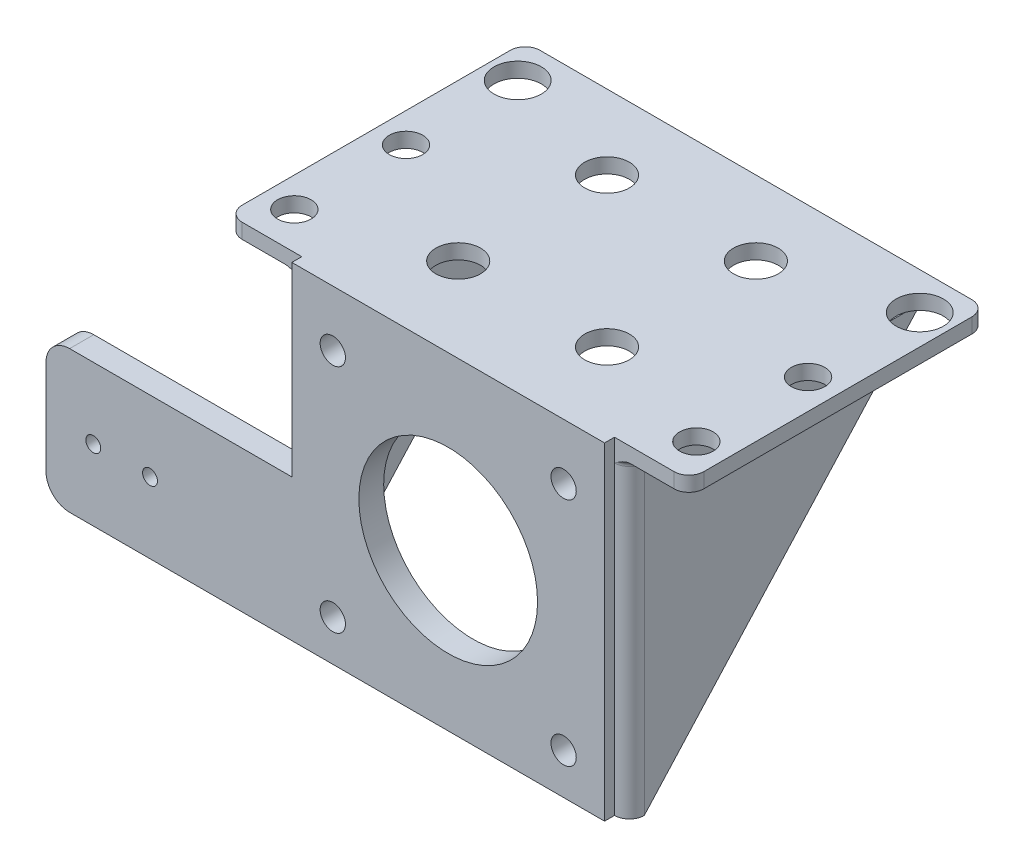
ISO-10303-21;
HEADER;
FILE_DESCRIPTION(('STEP AP214'),'2;1');
FILE_NAME('part.step','',(''),(''),'','','');
FILE_SCHEMA(('AUTOMOTIVE_DESIGN { 1 0 10303 214 1 1 1 1 }'));
ENDSEC;
DATA;
#1=APPLICATION_CONTEXT('core data for automotive mechanical design processes');
#2=APPLICATION_PROTOCOL_DEFINITION('international standard','automotive_design',2000,#1);
#3=PRODUCT_CONTEXT('',#1,'mechanical');
#4=PRODUCT('Part','Part','',(#3));
#5=PRODUCT_RELATED_PRODUCT_CATEGORY('part','',(#4));
#6=PRODUCT_DEFINITION_FORMATION('','',#4);
#7=PRODUCT_DEFINITION_CONTEXT('part definition',#1,'design');
#8=PRODUCT_DEFINITION('design','',#6,#7);
#9=PRODUCT_DEFINITION_SHAPE('','',#8);
#10=(LENGTH_UNIT() NAMED_UNIT(*) SI_UNIT(.MILLI.,.METRE.));
#11=(NAMED_UNIT(*) PLANE_ANGLE_UNIT() SI_UNIT($,.RADIAN.));
#12=(NAMED_UNIT(*) SI_UNIT($,.STERADIAN.) SOLID_ANGLE_UNIT());
#13=UNCERTAINTY_MEASURE_WITH_UNIT(LENGTH_MEASURE(1.E-05),#10,'distance_accuracy_value','');
#14=(GEOMETRIC_REPRESENTATION_CONTEXT(3) GLOBAL_UNCERTAINTY_ASSIGNED_CONTEXT((#13)) GLOBAL_UNIT_ASSIGNED_CONTEXT((#10,
#11,#12)) REPRESENTATION_CONTEXT('',''));
#15=CARTESIAN_POINT('',(0.,0.,0.));
#16=DIRECTION('',(0.,0.,1.));
#17=DIRECTION('',(1.,0.,0.));
#18=AXIS2_PLACEMENT_3D('',#15,#16,#17);
#19=CARTESIAN_POINT('',(1.73194791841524E-13,1.79856129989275E-13,2.00000000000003));
#20=DIRECTION('',(0.,0.,-1.));
#21=DIRECTION('',(-1.,0.,0.));
#22=AXIS2_PLACEMENT_3D('',#19,#20,#21);
#23=PLANE('',#22);
#24=DIRECTION('',(0.,-1.,0.));
#25=VECTOR('',#24,1.);
#26=CARTESIAN_POINT('',(-21.,20.0000000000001,2.00000000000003));
#27=LINE('',#26,#25);
#28=CARTESIAN_POINT('',(-21.,23.0000000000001,2.00000000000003));
#29=VERTEX_POINT('',#28);
#30=CARTESIAN_POINT('',(-21.,20.0000000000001,2.00000000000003));
#31=VERTEX_POINT('',#30);
#32=EDGE_CURVE('E425',#29,#31,#27,.T.);
#33=ORIENTED_EDGE('',*,*,#32,.F.);
#34=DIRECTION('',(-1.,0.,0.));
#35=VECTOR('',#34,1.);
#36=CARTESIAN_POINT('',(23.0000000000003,23.0000000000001,2.00000000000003));
#37=LINE('',#36,#35);
#38=CARTESIAN_POINT('',(-29.,23.0000000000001,2.00000000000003));
#39=VERTEX_POINT('',#38);
#40=EDGE_CURVE('E332',#39,#29,#37,.F.);
#41=ORIENTED_EDGE('',*,*,#40,.F.);
#42=DIRECTION('',(0.,1.,0.));
#43=VECTOR('',#42,1.);
#44=CARTESIAN_POINT('',(-29.,1.79856129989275E-13,2.00000000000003));
#45=LINE('',#44,#43);
#46=CARTESIAN_POINT('',(-29.,21.0000000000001,2.00000000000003));
#47=VERTEX_POINT('',#46);
#48=EDGE_CURVE('E407',#47,#39,#45,.T.);
#49=ORIENTED_EDGE('',*,*,#48,.F.);
#50=DIRECTION('',(-1.,0.,0.));
#51=VECTOR('',#50,1.);
#52=CARTESIAN_POINT('',(1.73194791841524E-13,21.0000000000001,2.00000000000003));
#53=LINE('',#52,#51);
#54=CARTESIAN_POINT('',(-23.2360679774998,21.0000000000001,2.00000000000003));
#55=VERTEX_POINT('',#54);
#56=EDGE_CURVE('E410',#55,#47,#53,.T.);
#57=ORIENTED_EDGE('',*,*,#56,.F.);
#58=CARTESIAN_POINT('',(-21.,20.0000000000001,2.00000000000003));
#59=CARTESIAN_POINT('',(-21.0573449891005,20.0405733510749,1.99997565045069));
#60=CARTESIAN_POINT('',(-21.1146802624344,20.0811727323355,2.00000289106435));
#61=CARTESIAN_POINT('',(-21.2196361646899,20.1546712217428,2.00000356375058));
#62=CARTESIAN_POINT('',(-21.2671893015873,20.1876671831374,1.99998562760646));
#63=CARTESIAN_POINT('',(-21.3525949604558,20.2459063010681,1.99984264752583));
#64=CARTESIAN_POINT('',(-21.3903459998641,20.2712976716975,1.99974134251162));
#65=CARTESIAN_POINT('',(-21.4557124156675,20.314674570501,1.99951040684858));
#66=CARTESIAN_POINT('',(-21.4832536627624,20.3327724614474,1.99939627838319));
#67=CARTESIAN_POINT('',(-21.5576757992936,20.3813481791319,1.99916706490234));
#68=CARTESIAN_POINT('',(-21.6046621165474,20.4116664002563,1.99910671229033));
#69=CARTESIAN_POINT('',(-21.6976726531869,20.4701554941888,1.99902962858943));
#70=CARTESIAN_POINT('',(-21.7436728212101,20.4983643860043,1.99901144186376));
#71=CARTESIAN_POINT('',(-21.8347565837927,20.5525342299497,1.99903477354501));
#72=CARTESIAN_POINT('',(-21.8798137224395,20.578539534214,1.99907417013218));
#73=CARTESIAN_POINT('',(-21.9690166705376,20.6281779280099,1.99922296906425));
#74=CARTESIAN_POINT('',(-22.0131332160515,20.6518634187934,1.99932968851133));
#75=CARTESIAN_POINT('',(-22.1050602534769,20.6991041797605,1.99956286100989));
#76=CARTESIAN_POINT('',(-22.1529257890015,20.7225530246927,1.99969014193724));
#77=CARTESIAN_POINT('',(-22.2481927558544,20.7665958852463,1.99982451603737));
#78=CARTESIAN_POINT('',(-22.2955639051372,20.7872551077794,1.99983515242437));
#79=CARTESIAN_POINT('',(-22.3896670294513,20.8256480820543,1.99977383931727));
#80=CARTESIAN_POINT('',(-22.436368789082,20.8434557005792,1.99970459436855));
#81=CARTESIAN_POINT('',(-22.5289261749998,20.8760883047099,1.99953479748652));
#82=CARTESIAN_POINT('',(-22.5747518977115,20.8909974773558,1.9994354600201));
#83=CARTESIAN_POINT('',(-22.6460475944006,20.9121153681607,1.99935776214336));
#84=CARTESIAN_POINT('',(-22.6712633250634,20.9191895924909,1.99934488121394));
#85=CARTESIAN_POINT('',(-22.7218670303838,20.9325516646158,1.99934795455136));
#86=CARTESIAN_POINT('',(-22.7472547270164,20.9388405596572,1.99936386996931));
#87=CARTESIAN_POINT('',(-22.7981831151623,20.9505804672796,1.99941414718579));
#88=CARTESIAN_POINT('',(-22.8237235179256,20.9560327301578,1.99944848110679));
#89=CARTESIAN_POINT('',(-22.8749330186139,20.9660495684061,1.9995278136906));
#90=CARTESIAN_POINT('',(-22.9006018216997,20.970615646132,1.99957279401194));
#91=CARTESIAN_POINT('',(-22.9520377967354,20.9788113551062,1.99966515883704));
#92=CARTESIAN_POINT('',(-22.9778046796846,20.9824427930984,1.99971253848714));
#93=CARTESIAN_POINT('',(-23.0294005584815,20.9887221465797,1.99980210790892));
#94=CARTESIAN_POINT('',(-23.0552292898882,20.991372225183,1.99984430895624));
#95=CARTESIAN_POINT('',(-23.1069071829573,20.9956437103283,1.99991648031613));
#96=CARTESIAN_POINT('',(-23.1327561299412,20.9972676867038,1.99994648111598));
#97=CARTESIAN_POINT('',(-23.1844253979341,20.9994443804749,1.99998829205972));
#98=CARTESIAN_POINT('',(-23.2102455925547,21.0000001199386,2.00000015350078));
#99=CARTESIAN_POINT('',(-23.2360679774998,21.0000000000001,2.00000000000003));
#100=B_SPLINE_CURVE_WITH_KNOTS('',3,(#58,#59,#60,#61,#62,#63,#64,#65,#66,#67,#68,#69,#70,#71,
#72,#73,#74,#75,#76,#77,#78,#79,#80,#81,#82,#83,#84,#85,#86,#87,#88,#89,#90,#91,#92,#93,#94,#95,
#96,#97,#98,#99),.UNSPECIFIED.,.F.,.F.,(4,2,2,2,2,2,2,2,2,2,2,2,2,2,2,2,2,2,2,2,4),(0.,
0.210752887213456,0.384388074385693,0.520870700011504,0.61973712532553,0.787484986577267,
0.949349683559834,1.10539832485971,1.25559026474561,1.41544543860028,1.57043087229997,
1.72031921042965,1.86482117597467,1.94337873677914,2.02183039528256,2.100163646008,
2.17836291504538,2.25640986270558,2.33428374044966,2.41196180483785,2.48941979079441),.UNSPECIFIED.);
#101=EDGE_CURVE('E279',#31,#55,#100,.T.);
#102=ORIENTED_EDGE('',*,*,#101,.F.);
#103=EDGE_LOOP('',(#33,#41,#49,#57,#102));
#104=FACE_BOUND('',#103,.T.);
#105=ADVANCED_FACE('F33',(#104),#23,.F.);
#106=DIRECTION('',(0.,1.,0.));
#107=VECTOR('',#106,1.);
#108=CARTESIAN_POINT('',(21.0000000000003,20.0000000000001,2.00000000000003));
#109=LINE('',#108,#107);
#110=CARTESIAN_POINT('',(21.0000000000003,20.0000000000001,2.00000000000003));
#111=VERTEX_POINT('',#110);
#112=CARTESIAN_POINT('',(21.0000000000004,23.0000000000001,2.00000000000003));
#113=VERTEX_POINT('',#112);
#114=EDGE_CURVE('E703',#111,#113,#109,.T.);
#115=ORIENTED_EDGE('',*,*,#114,.F.);
#116=CARTESIAN_POINT('',(23.2360679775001,21.0000000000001,2.00000000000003));
#117=CARTESIAN_POINT('',(23.2102424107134,21.0000001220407,2.00000015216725));
#118=CARTESIAN_POINT('',(23.1844190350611,20.9994442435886,1.99998819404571));
#119=CARTESIAN_POINT('',(23.1327443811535,20.997267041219,1.99994607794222));
#120=CARTESIAN_POINT('',(23.1068932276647,20.9956427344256,1.99991586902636));
#121=CARTESIAN_POINT('',(23.0552118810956,20.9913704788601,1.99984324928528));
#122=CARTESIAN_POINT('',(23.0293818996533,20.988719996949,1.99980080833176));
#123=CARTESIAN_POINT('',(22.9777844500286,20.9824398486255,1.99971079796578));
#124=CARTESIAN_POINT('',(22.9520172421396,20.9788080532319,1.99966321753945));
#125=CARTESIAN_POINT('',(22.9005815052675,20.9706117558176,1.99957054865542));
#126=CARTESIAN_POINT('',(22.874913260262,20.9660454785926,1.99952546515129));
#127=CARTESIAN_POINT('',(22.8237057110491,20.9560284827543,1.99944608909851));
#128=CARTESIAN_POINT('',(22.7981666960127,20.9505762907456,1.99941181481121));
#129=CARTESIAN_POINT('',(22.7472418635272,20.9388368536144,1.99936181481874));
#130=CARTESIAN_POINT('',(22.7218563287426,20.9325483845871,1.99934611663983));
#131=CARTESIAN_POINT('',(22.671257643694,20.9191876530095,1.99934384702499));
#132=CARTESIAN_POINT('',(22.6460447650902,20.9121143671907,1.99935731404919));
#133=CARTESIAN_POINT('',(22.5747403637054,20.8909943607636,1.99943630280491));
#134=CARTESIAN_POINT('',(22.5289032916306,20.8760813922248,1.99953605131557));
#135=CARTESIAN_POINT('',(22.4363315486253,20.8434424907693,1.99970575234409));
#136=CARTESIAN_POINT('',(22.3896266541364,20.8256327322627,1.99977446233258));
#137=CARTESIAN_POINT('',(22.2955246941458,20.787238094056,1.99983480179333));
#138=CARTESIAN_POINT('',(22.2481577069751,20.7665796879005,1.9998237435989));
#139=CARTESIAN_POINT('',(22.1529053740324,20.7225424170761,1.99968934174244));
#140=CARTESIAN_POINT('',(22.1050501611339,20.6990986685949,1.99956249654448));
#141=CARTESIAN_POINT('',(22.0131237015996,20.6518588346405,1.9993299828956));
#142=CARTESIAN_POINT('',(21.9689977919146,20.628168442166,1.99922350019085));
#143=CARTESIAN_POINT('',(21.8797830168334,20.5785227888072,1.99907470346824));
#144=CARTESIAN_POINT('',(21.8347233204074,20.5525152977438,1.99903504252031));
#145=CARTESIAN_POINT('',(21.7436404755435,20.4983445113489,1.99901131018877));
#146=CARTESIAN_POINT('',(21.6976436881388,20.4701370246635,1.99902935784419));
#147=CARTESIAN_POINT('',(21.6046451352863,20.4116549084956,1.99910647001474));
#148=CARTESIAN_POINT('',(21.5576673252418,20.381342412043,1.99916699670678));
#149=CARTESIAN_POINT('',(21.4832475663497,20.3327686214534,1.99939635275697));
#150=CARTESIAN_POINT('',(21.4557002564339,20.314666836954,1.99951054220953));
#151=CARTESIAN_POINT('',(21.3903259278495,20.2712846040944,1.99974151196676));
#152=CARTESIAN_POINT('',(21.3525730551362,20.2458917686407,1.99984276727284));
#153=CARTESIAN_POINT('',(21.2671676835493,20.1876523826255,1.99998565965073));
#154=CARTESIAN_POINT('',(21.2196166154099,20.1546576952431,2.00000357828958));
#155=CARTESIAN_POINT('',(21.1146686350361,20.0811645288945,2.00000289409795));
#156=CARTESIAN_POINT('',(21.0573391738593,20.040569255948,1.99997566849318));
#157=CARTESIAN_POINT('',(21.0000000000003,20.0000000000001,2.00000000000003));
#158=B_SPLINE_CURVE_WITH_KNOTS('',3,(#116,#117,#118,#119,#120,#121,#122,#123,#124,#125,#126,
#127,#128,#129,#130,#131,#132,#133,#134,#135,#136,#137,#138,#139,#140,#141,#142,#143,#144,#145,
#146,#147,#148,#149,#150,#151,#152,#153,#154,#155,#156,#157),.UNSPECIFIED.,.F.,.F.,(4,2,2,2,2,2,
2,2,2,2,2,2,2,2,2,2,2,2,2,2,4),(0.,0.0774675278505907,0.155152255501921,0.233029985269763,
0.31107804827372,0.389275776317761,0.467604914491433,0.546049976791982,0.624598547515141,
0.769136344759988,0.9190357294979,1.07400877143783,1.23382946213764,1.3840530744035,
1.54011162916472,1.70196549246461,1.86968261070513,1.96857064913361,2.10506028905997,
2.27868820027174,2.48941974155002),.UNSPECIFIED.);
#159=CARTESIAN_POINT('',(23.2360679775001,21.0000000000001,2.00000000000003));
#160=VERTEX_POINT('',#159);
#161=EDGE_CURVE('E402',#160,#111,#158,.T.);
#162=ORIENTED_EDGE('',*,*,#161,.F.);
#163=DIRECTION('',(-1.,0.,0.));
#164=VECTOR('',#163,1.);
#165=CARTESIAN_POINT('',(1.73194791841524E-13,21.0000000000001,2.00000000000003));
#166=LINE('',#165,#164);
#167=CARTESIAN_POINT('',(29.0000000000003,21.0000000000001,2.00000000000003));
#168=VERTEX_POINT('',#167);
#169=EDGE_CURVE('E405',#168,#160,#166,.T.);
#170=ORIENTED_EDGE('',*,*,#169,.F.);
#171=DIRECTION('',(0.,1.,0.));
#172=VECTOR('',#171,1.);
#173=CARTESIAN_POINT('',(29.0000000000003,11.5000000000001,2.00000000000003));
#174=LINE('',#173,#172);
#175=CARTESIAN_POINT('',(29.0000000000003,23.0000000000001,2.00000000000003));
#176=VERTEX_POINT('',#175);
#177=EDGE_CURVE('E360',#176,#168,#174,.F.);
#178=ORIENTED_EDGE('',*,*,#177,.F.);
#179=EDGE_CURVE('E336',#113,#176,#37,.F.);
#180=ORIENTED_EDGE('',*,*,#179,.F.);
#181=EDGE_LOOP('',(#115,#162,#170,#178,#180));
#182=FACE_BOUND('',#181,.T.);
#183=ADVANCED_FACE('F474',(#182),#23,.F.);
#184=CARTESIAN_POINT('',(-23.,21.0000000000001,-38.));
#185=DIRECTION('',(-1.,0.,0.));
#186=DIRECTION('',(0.,-1.,0.));
#187=AXIS2_PLACEMENT_3D('',#184,#185,#186);
#188=PLANE('',#187);
#189=DIRECTION('',(0.,-1.,0.));
#190=VECTOR('',#189,1.);
#191=CARTESIAN_POINT('',(-23.,10.5000000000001,0.));
#192=LINE('',#191,#190);
#193=CARTESIAN_POINT('',(-23.,-12.4275000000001,0.));
#194=VERTEX_POINT('',#193);
#195=CARTESIAN_POINT('',(-23.,-21.0000000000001,0.));
#196=VERTEX_POINT('',#195);
#197=EDGE_CURVE('E292',#194,#196,#192,.T.);
#198=ORIENTED_EDGE('',*,*,#197,.F.);
#199=DIRECTION('',(0.,0.,1.));
#200=VECTOR('',#199,1.);
#201=CARTESIAN_POINT('',(-23.,-12.4275000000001,0.0950000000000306));
#202=LINE('',#201,#200);
#203=CARTESIAN_POINT('',(-23.,-12.4275000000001,-7.70341134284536));
#204=VERTEX_POINT('',#203);
#205=EDGE_CURVE('E777',#204,#194,#202,.T.);
#206=ORIENTED_EDGE('',*,*,#205,.F.);
#207=DIRECTION('',(0.,1.,0.));
#208=VECTOR('',#207,1.);
#209=CARTESIAN_POINT('',(-23.,-12.4275000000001,-7.70341134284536));
#210=LINE('',#209,#208);
#211=CARTESIAN_POINT('',(-23.,-10.5225000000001,-7.70341134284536));
#212=VERTEX_POINT('',#211);
#213=EDGE_CURVE('E789',#204,#212,#210,.T.);
#214=ORIENTED_EDGE('',*,*,#213,.T.);
#215=DIRECTION('',(0.,0.,1.));
#216=VECTOR('',#215,1.);
#217=CARTESIAN_POINT('',(-23.,-10.5225000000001,0.0950000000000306));
#218=LINE('',#217,#216);
#219=CARTESIAN_POINT('',(-23.,-10.5225000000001,0.));
#220=VERTEX_POINT('',#219);
#221=EDGE_CURVE('E677',#212,#220,#218,.T.);
#222=ORIENTED_EDGE('',*,*,#221,.T.);
#223=CARTESIAN_POINT('',(-23.,20.0000000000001,0.));
#224=VERTEX_POINT('',#223);
#225=EDGE_CURVE('E294',#224,#220,#192,.T.);
#226=ORIENTED_EDGE('',*,*,#225,.F.);
#227=DIRECTION('',(0.,0.,1.));
#228=VECTOR('',#227,1.);
#229=CARTESIAN_POINT('',(-23.,20.0000000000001,-18.));
#230=LINE('',#229,#228);
#231=CARTESIAN_POINT('',(-23.,20.0000000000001,-37.095238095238));
#232=VERTEX_POINT('',#231);
#233=EDGE_CURVE('E591',#224,#232,#230,.F.);
#234=ORIENTED_EDGE('',*,*,#233,.T.);
#235=DIRECTION('',(0.,-0.741535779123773,0.670913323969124));
#236=VECTOR('',#235,1.);
#237=CARTESIAN_POINT('',(-23.,0.0523690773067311,-19.0473815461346));
#238=LINE('',#237,#236);
#239=EDGE_CURVE('E365',#232,#196,#238,.T.);
#240=ORIENTED_EDGE('',*,*,#239,.T.);
#241=EDGE_LOOP('',(#198,#206,#214,#222,#226,#234,#240));
#242=FACE_BOUND('',#241,.T.);
#243=ADVANCED_FACE('F674',(#242),#188,.T.);
#244=CARTESIAN_POINT('',(-50.845,-5.1250000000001,0.0950000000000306));
#245=DIRECTION('',(0.,0.,1.));
#246=DIRECTION('',(1.,0.,0.));
#247=AXIS2_PLACEMENT_3D('',#244,#245,#246);
#248=PLANE('',#247);
#249=CARTESIAN_POINT('',(-40.05,-11.4750000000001,0.0950000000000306));
#250=DIRECTION('',(0.,0.,1.));
#251=DIRECTION('',(1.,0.,0.));
#252=AXIS2_PLACEMENT_3D('',#249,#250,#251);
#253=CIRCLE('',#252,0.999999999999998);
#254=CARTESIAN_POINT('',(-39.05,-11.4750000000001,0.0950000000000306));
#255=VERTEX_POINT('',#254);
#256=EDGE_CURVE('E787',#255,#255,#253,.T.);
#257=ORIENTED_EDGE('',*,*,#256,.T.);
#258=EDGE_LOOP('',(#257));
#259=FACE_BOUND('',#258,.T.);
#260=CARTESIAN_POINT('',(-47.67,-11.4750000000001,0.0950000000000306));
#261=DIRECTION('',(0.,0.,1.));
#262=DIRECTION('',(1.,0.,0.));
#263=AXIS2_PLACEMENT_3D('',#260,#261,#262);
#264=CIRCLE('',#263,0.999999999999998);
#265=CARTESIAN_POINT('',(-46.67,-11.4750000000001,0.0950000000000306));
#266=VERTEX_POINT('',#265);
#267=EDGE_CURVE('E783',#266,#266,#264,.T.);
#268=ORIENTED_EDGE('',*,*,#267,.T.);
#269=EDGE_LOOP('',(#268));
#270=FACE_BOUND('',#269,.T.);
#271=DIRECTION('',(0.,-1.,0.));
#272=VECTOR('',#271,1.);
#273=CARTESIAN_POINT('',(-22.9977424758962,10.5000000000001,0.0950000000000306));
#274=LINE('',#273,#272);
#275=CARTESIAN_POINT('',(-22.9977424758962,-21.0000000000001,0.0950000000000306));
#276=VERTEX_POINT('',#275);
#277=CARTESIAN_POINT('',(-22.9977424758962,-1.95000000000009,0.0950000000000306));
#278=VERTEX_POINT('',#277);
#279=EDGE_CURVE('E11',#276,#278,#274,.F.);
#280=ORIENTED_EDGE('',*,*,#279,.F.);
#281=DIRECTION('',(1.,0.,0.));
#282=VECTOR('',#281,1.);
#283=CARTESIAN_POINT('',(-21.,-21.0000000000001,0.0950000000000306));
#284=LINE('',#283,#282);
#285=CARTESIAN_POINT('',(-50.845,-21.0000000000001,0.0950000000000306));
#286=VERTEX_POINT('',#285);
#287=EDGE_CURVE('E806',#286,#276,#284,.T.);
#288=ORIENTED_EDGE('',*,*,#287,.F.);
#289=CARTESIAN_POINT('',(-50.845,-17.8250000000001,0.0950000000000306));
#290=DIRECTION('',(0.,0.,1.));
#291=DIRECTION('',(-1.,0.,0.));
#292=AXIS2_PLACEMENT_3D('',#289,#290,#291);
#293=CIRCLE('',#292,3.175);
#294=CARTESIAN_POINT('',(-54.02,-17.8250000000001,0.0950000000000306));
#295=VERTEX_POINT('',#294);
#296=EDGE_CURVE('E803',#295,#286,#293,.T.);
#297=ORIENTED_EDGE('',*,*,#296,.F.);
#298=DIRECTION('',(0.,-1.,0.));
#299=VECTOR('',#298,1.);
#300=CARTESIAN_POINT('',(-54.02,-17.8250000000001,0.0950000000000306));
#301=LINE('',#300,#299);
#302=CARTESIAN_POINT('',(-54.02,-5.1250000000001,0.0950000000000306));
#303=VERTEX_POINT('',#302);
#304=EDGE_CURVE('E800',#303,#295,#301,.T.);
#305=ORIENTED_EDGE('',*,*,#304,.F.);
#306=CARTESIAN_POINT('',(-50.845,-5.1250000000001,0.0950000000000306));
#307=DIRECTION('',(0.,0.,1.));
#308=DIRECTION('',(1.,0.,0.));
#309=AXIS2_PLACEMENT_3D('',#306,#307,#308);
#310=CIRCLE('',#309,3.175);
#311=CARTESIAN_POINT('',(-50.845,-1.9500000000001,0.0950000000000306));
#312=VERTEX_POINT('',#311);
#313=EDGE_CURVE('E797',#312,#303,#310,.T.);
#314=ORIENTED_EDGE('',*,*,#313,.F.);
#315=DIRECTION('',(-1.,0.,0.));
#316=VECTOR('',#315,1.);
#317=CARTESIAN_POINT('',(-21.,-1.95000000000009,0.0950000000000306));
#318=LINE('',#317,#316);
#319=EDGE_CURVE('E795',#278,#312,#318,.T.);
#320=ORIENTED_EDGE('',*,*,#319,.F.);
#321=EDGE_LOOP('',(#280,#288,#297,#305,#314,#320));
#322=FACE_BOUND('',#321,.T.);
#323=DIRECTION('',(-1.,0.,0.));
#324=VECTOR('',#323,1.);
#325=CARTESIAN_POINT('',(-37.1370542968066,-12.4275000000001,0.0950000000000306));
#326=LINE('',#325,#324);
#327=CARTESIAN_POINT('',(-23.,-12.4275000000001,0.0950000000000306));
#328=VERTEX_POINT('',#327);
#329=CARTESIAN_POINT('',(-37.1370542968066,-12.4275000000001,0.0950000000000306));
#330=VERTEX_POINT('',#329);
#331=EDGE_CURVE('E1489',#328,#330,#326,.T.);
#332=ORIENTED_EDGE('',*,*,#331,.F.);
#333=DIRECTION('',(0.,1.,0.));
#334=VECTOR('',#333,1.);
#335=CARTESIAN_POINT('',(-23.,-12.4275000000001,0.0950000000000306));
#336=LINE('',#335,#334);
#337=CARTESIAN_POINT('',(-23.,-10.5225000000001,0.0950000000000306));
#338=VERTEX_POINT('',#337);
#339=EDGE_CURVE('E1495',#328,#338,#336,.T.);
#340=ORIENTED_EDGE('',*,*,#339,.T.);
#341=DIRECTION('',(-1.,0.,0.));
#342=VECTOR('',#341,1.);
#343=CARTESIAN_POINT('',(-37.1370542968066,-10.5225000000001,0.0950000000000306));
#344=LINE('',#343,#342);
#345=CARTESIAN_POINT('',(-37.1370542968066,-10.5225000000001,0.0950000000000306));
#346=VERTEX_POINT('',#345);
#347=EDGE_CURVE('E1480',#338,#346,#344,.T.);
#348=ORIENTED_EDGE('',*,*,#347,.T.);
#349=DIRECTION('',(0.,1.,0.));
#350=VECTOR('',#349,1.);
#351=CARTESIAN_POINT('',(-37.1370542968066,-12.4275000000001,0.0950000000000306));
#352=LINE('',#351,#350);
#353=EDGE_CURVE('E784',#330,#346,#352,.T.);
#354=ORIENTED_EDGE('',*,*,#353,.F.);
#355=EDGE_LOOP('',(#332,#340,#348,#354));
#356=FACE_BOUND('',#355,.T.);
#357=ADVANCED_FACE('F829',(#259,#270,#322,#356),#248,.F.);
#358=CARTESIAN_POINT('',(23.0000000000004,-21.0000000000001,0.));
#359=DIRECTION('',(1.,0.,0.));
#360=DIRECTION('',(0.,1.,0.));
#361=AXIS2_PLACEMENT_3D('',#358,#359,#360);
#362=PLANE('',#361);
#363=DIRECTION('',(0.,1.,0.));
#364=VECTOR('',#363,1.);
#365=CARTESIAN_POINT('',(23.0000000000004,-10.5,0.));
#366=LINE('',#365,#364);
#367=CARTESIAN_POINT('',(23.0000000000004,-21.0000000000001,0.));
#368=VERTEX_POINT('',#367);
#369=CARTESIAN_POINT('',(23.0000000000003,20.0000000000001,0.));
#370=VERTEX_POINT('',#369);
#371=EDGE_CURVE('E301',#368,#370,#366,.T.);
#372=ORIENTED_EDGE('',*,*,#371,.F.);
#373=DIRECTION('',(0.,-0.741535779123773,0.670913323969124));
#374=VECTOR('',#373,1.);
#375=CARTESIAN_POINT('',(23.0000000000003,0.0523690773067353,-19.0473815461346));
#376=LINE('',#375,#374);
#377=CARTESIAN_POINT('',(23.0000000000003,20.0000000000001,-37.095238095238));
#378=VERTEX_POINT('',#377);
#379=EDGE_CURVE('E370',#368,#378,#376,.F.);
#380=ORIENTED_EDGE('',*,*,#379,.T.);
#381=DIRECTION('',(0.,0.,1.));
#382=VECTOR('',#381,1.);
#383=CARTESIAN_POINT('',(23.0000000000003,20.0000000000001,1.00000000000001));
#384=LINE('',#383,#382);
#385=EDGE_CURVE('E593',#378,#370,#384,.T.);
#386=ORIENTED_EDGE('',*,*,#385,.T.);
#387=EDGE_LOOP('',(#372,#380,#386));
#388=FACE_BOUND('',#387,.T.);
#389=ADVANCED_FACE('F35',(#388),#362,.T.);
#390=CARTESIAN_POINT('',(21.5000000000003,21.0000000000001,-38.));
#391=DIRECTION('',(-1.,0.,0.));
#392=DIRECTION('',(0.,-1.,0.));
#393=AXIS2_PLACEMENT_3D('',#390,#391,#392);
#394=PLANE('',#393);
#395=DIRECTION('',(0.,0.,1.));
#396=VECTOR('',#395,1.);
#397=CARTESIAN_POINT('',(21.5000000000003,21.0000000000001,2.00000000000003));
#398=LINE('',#397,#396);
#399=CARTESIAN_POINT('',(21.5000000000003,21.0000000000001,-38.));
#400=VERTEX_POINT('',#399);
#401=CARTESIAN_POINT('',(21.5000000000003,21.0000000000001,0.));
#402=VERTEX_POINT('',#401);
#403=EDGE_CURVE('E369',#400,#402,#398,.T.);
#404=ORIENTED_EDGE('',*,*,#403,.F.);
#405=DIRECTION('',(0.,-0.741535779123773,0.670913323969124));
#406=VECTOR('',#405,1.);
#407=CARTESIAN_POINT('',(21.5000000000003,0.0523690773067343,-19.0473815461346));
#408=LINE('',#407,#406);
#409=CARTESIAN_POINT('',(21.5000000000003,-21.0000000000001,0.));
#410=VERTEX_POINT('',#409);
#411=EDGE_CURVE('E374',#400,#410,#408,.T.);
#412=ORIENTED_EDGE('',*,*,#411,.T.);
#413=DIRECTION('',(0.,-1.,0.));
#414=VECTOR('',#413,1.);
#415=CARTESIAN_POINT('',(21.5000000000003,0.,0.));
#416=LINE('',#415,#414);
#417=EDGE_CURVE('E615',#410,#402,#416,.F.);
#418=ORIENTED_EDGE('',*,*,#417,.T.);
#419=EDGE_LOOP('',(#404,#412,#418));
#420=FACE_BOUND('',#419,.T.);
#421=ADVANCED_FACE('F900',(#420),#394,.T.);
#422=CARTESIAN_POINT('',(-21.4971376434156,0.,0.));
#423=DIRECTION('',(0.,0.,1.));
#424=DIRECTION('',(0.,-1.,0.));
#425=AXIS2_PLACEMENT_3D('',#422,#423,#424);
#426=PLANE('',#425);
#427=CARTESIAN_POINT('',(-15.5000000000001,15.5000000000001,0.));
#428=DIRECTION('',(0.,0.,1.));
#429=DIRECTION('',(1.,0.,0.));
#430=AXIS2_PLACEMENT_3D('',#427,#428,#429);
#431=CIRCLE('',#430,1.70000000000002);
#432=CARTESIAN_POINT('',(-13.8000000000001,15.5000000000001,0.));
#433=VERTEX_POINT('',#432);
#434=EDGE_CURVE('E371',#433,#433,#431,.T.);
#435=ORIENTED_EDGE('',*,*,#434,.T.);
#436=EDGE_LOOP('',(#435));
#437=FACE_BOUND('',#436,.T.);
#438=CARTESIAN_POINT('',(-15.5000000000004,-15.5000000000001,0.));
#439=DIRECTION('',(0.,0.,1.));
#440=DIRECTION('',(1.,0.,0.));
#441=AXIS2_PLACEMENT_3D('',#438,#439,#440);
#442=CIRCLE('',#441,1.70000000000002);
#443=CARTESIAN_POINT('',(-13.8000000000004,-15.5000000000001,0.));
#444=VERTEX_POINT('',#443);
#445=EDGE_CURVE('E375',#444,#444,#442,.T.);
#446=ORIENTED_EDGE('',*,*,#445,.T.);
#447=EDGE_LOOP('',(#446));
#448=FACE_BOUND('',#447,.T.);
#449=CARTESIAN_POINT('',(15.5000000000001,-15.5000000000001,0.));
#450=DIRECTION('',(0.,0.,1.));
#451=DIRECTION('',(1.,0.,0.));
#452=AXIS2_PLACEMENT_3D('',#449,#450,#451);
#453=CIRCLE('',#452,1.70000000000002);
#454=CARTESIAN_POINT('',(17.2000000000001,-15.5000000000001,0.));
#455=VERTEX_POINT('',#454);
#456=EDGE_CURVE('E378',#455,#455,#453,.T.);
#457=ORIENTED_EDGE('',*,*,#456,.T.);
#458=EDGE_LOOP('',(#457));
#459=FACE_BOUND('',#458,.T.);
#460=CARTESIAN_POINT('',(15.5000000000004,15.5000000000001,0.));
#461=DIRECTION('',(0.,0.,1.));
#462=DIRECTION('',(1.,0.,0.));
#463=AXIS2_PLACEMENT_3D('',#460,#461,#462);
#464=CIRCLE('',#463,1.70000000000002);
#465=CARTESIAN_POINT('',(17.2000000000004,15.5000000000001,0.));
#466=VERTEX_POINT('',#465);
#467=EDGE_CURVE('E381',#466,#466,#464,.T.);
#468=ORIENTED_EDGE('',*,*,#467,.T.);
#469=EDGE_LOOP('',(#468));
#470=FACE_BOUND('',#469,.T.);
#471=CARTESIAN_POINT('',(0.,0.,0.));
#472=DIRECTION('',(0.,0.,1.));
#473=DIRECTION('',(1.,0.,0.));
#474=AXIS2_PLACEMENT_3D('',#471,#472,#473);
#475=CIRCLE('',#474,12.0000000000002);
#476=CARTESIAN_POINT('',(12.0000000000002,0.,0.));
#477=VERTEX_POINT('',#476);
#478=EDGE_CURVE('E384',#477,#477,#475,.T.);
#479=ORIENTED_EDGE('',*,*,#478,.T.);
#480=EDGE_LOOP('',(#479));
#481=FACE_BOUND('',#480,.T.);
#482=DIRECTION('',(1.,0.,0.));
#483=VECTOR('',#482,1.);
#484=CARTESIAN_POINT('',(-23.,-21.0000000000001,0.));
#485=LINE('',#484,#483);
#486=CARTESIAN_POINT('',(-21.5,-21.0000000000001,0.));
#487=VERTEX_POINT('',#486);
#488=EDGE_CURVE('E305',#487,#410,#485,.T.);
#489=ORIENTED_EDGE('',*,*,#488,.F.);
#490=DIRECTION('',(0.,1.,0.));
#491=VECTOR('',#490,1.);
#492=CARTESIAN_POINT('',(-21.5,-21.0000000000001,0.));
#493=LINE('',#492,#491);
#494=CARTESIAN_POINT('',(-21.5,21.0000000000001,0.));
#495=VERTEX_POINT('',#494);
#496=EDGE_CURVE('E594',#495,#487,#493,.F.);
#497=ORIENTED_EDGE('',*,*,#496,.F.);
#498=DIRECTION('',(1.,0.,0.));
#499=VECTOR('',#498,1.);
#500=CARTESIAN_POINT('',(31.0000000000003,21.0000000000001,0.));
#501=LINE('',#500,#499);
#502=EDGE_CURVE('E526',#402,#495,#501,.F.);
#503=ORIENTED_EDGE('',*,*,#502,.F.);
#504=ORIENTED_EDGE('',*,*,#417,.F.);
#505=EDGE_LOOP('',(#489,#497,#503,#504));
#506=FACE_BOUND('',#505,.T.);
#507=ADVANCED_FACE('F898',(#437,#448,#459,#470,#481,#506),#426,.F.);
#508=CARTESIAN_POINT('',(-21.5,-21.0000000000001,0.));
#509=DIRECTION('',(1.,0.,0.));
#510=DIRECTION('',(0.,1.,0.));
#511=AXIS2_PLACEMENT_3D('',#508,#509,#510);
#512=PLANE('',#511);
#513=DIRECTION('',(0.,-0.741535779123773,0.670913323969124));
#514=VECTOR('',#513,1.);
#515=CARTESIAN_POINT('',(-21.5,0.0523690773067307,-19.0473815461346));
#516=LINE('',#515,#514);
#517=CARTESIAN_POINT('',(-21.5,21.0000000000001,-38.));
#518=VERTEX_POINT('',#517);
#519=EDGE_CURVE('E514',#487,#518,#516,.F.);
#520=ORIENTED_EDGE('',*,*,#519,.T.);
#521=DIRECTION('',(0.,0.,1.));
#522=VECTOR('',#521,1.);
#523=CARTESIAN_POINT('',(-21.5,21.0000000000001,2.00000000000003));
#524=LINE('',#523,#522);
#525=EDGE_CURVE('E366',#495,#518,#524,.F.);
#526=ORIENTED_EDGE('',*,*,#525,.F.);
#527=ORIENTED_EDGE('',*,*,#496,.T.);
#528=EDGE_LOOP('',(#520,#526,#527));
#529=FACE_BOUND('',#528,.T.);
#530=ADVANCED_FACE('F896',(#529),#512,.T.);
#531=CARTESIAN_POINT('',(-24.,20.0000000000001,-18.));
#532=DIRECTION('',(0.,0.,1.));
#533=DIRECTION('',(1.,0.,0.));
#534=AXIS2_PLACEMENT_3D('',#531,#532,#533);
#535=CYLINDRICAL_SURFACE('',#534,1.);
#536=ORIENTED_EDGE('',*,*,#233,.F.);
#537=CARTESIAN_POINT('',(-24.,20.0000000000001,0.));
#538=DIRECTION('',(0.,0.,-1.));
#539=DIRECTION('',(-1.,0.,0.));
#540=AXIS2_PLACEMENT_3D('',#537,#538,#539);
#541=CIRCLE('',#540,1.);
#542=CARTESIAN_POINT('',(-24.,21.0000000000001,0.));
#543=VERTEX_POINT('',#542);
#544=EDGE_CURVE('E588',#224,#543,#541,.F.);
#545=ORIENTED_EDGE('',*,*,#544,.T.);
#546=DIRECTION('',(0.,0.,1.));
#547=VECTOR('',#546,1.);
#548=CARTESIAN_POINT('',(-24.,21.0000000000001,2.00000000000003));
#549=LINE('',#548,#547);
#550=CARTESIAN_POINT('',(-24.,21.0000000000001,-31.9604688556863));
#551=VERTEX_POINT('',#550);
#552=EDGE_CURVE('E37',#551,#543,#549,.T.);
#553=ORIENTED_EDGE('',*,*,#552,.F.);
#554=DIRECTION('',(0.,0.,1.));
#555=VECTOR('',#554,1.);
#556=CARTESIAN_POINT('',(-24.,21.0000000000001,-18.));
#557=LINE('',#556,#555);
#558=CARTESIAN_POINT('',(-24.,21.0000000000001,-34.0395311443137));
#559=VERTEX_POINT('',#558);
#560=EDGE_CURVE('E268',#551,#559,#557,.F.);
#561=ORIENTED_EDGE('',*,*,#560,.T.);
#562=CARTESIAN_POINT('',(-24.,21.0000000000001,-38.));
#563=VERTEX_POINT('',#562);
#564=EDGE_CURVE('E492',#563,#559,#549,.T.);
#565=ORIENTED_EDGE('',*,*,#564,.F.);
#566=CARTESIAN_POINT('',(-24.,20.0000000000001,-37.095238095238));
#567=DIRECTION('',(0.,0.670913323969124,0.741535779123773));
#568=DIRECTION('',(0.,-0.741535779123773,0.670913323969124));
#569=AXIS2_PLACEMENT_3D('',#566,#567,#568);
#570=ELLIPSE('',#569,1.34855259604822,1.);
#571=EDGE_CURVE('E362',#563,#232,#570,.F.);
#572=ORIENTED_EDGE('',*,*,#571,.T.);
#573=EDGE_LOOP('',(#536,#545,#553,#561,#565,#572));
#574=FACE_BOUND('',#573,.T.);
#575=ADVANCED_FACE('F668',(#574),#535,.F.);
#576=CARTESIAN_POINT('',(24.0000000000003,20.0000000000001,1.00000000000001));
#577=DIRECTION('',(0.,0.,1.));
#578=DIRECTION('',(1.,0.,0.));
#579=AXIS2_PLACEMENT_3D('',#576,#577,#578);
#580=CYLINDRICAL_SURFACE('',#579,1.);
#581=DIRECTION('',(0.,0.,1.));
#582=VECTOR('',#581,1.);
#583=CARTESIAN_POINT('',(24.0000000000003,21.0000000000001,2.00000000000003));
#584=LINE('',#583,#582);
#585=CARTESIAN_POINT('',(24.0000000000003,21.0000000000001,0.));
#586=VERTEX_POINT('',#585);
#587=CARTESIAN_POINT('',(24.0000000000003,21.0000000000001,-31.9604688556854));
#588=VERTEX_POINT('',#587);
#589=EDGE_CURVE('E264',#586,#588,#584,.F.);
#590=ORIENTED_EDGE('',*,*,#589,.F.);
#591=CARTESIAN_POINT('',(24.0000000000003,20.0000000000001,0.));
#592=DIRECTION('',(0.,0.,1.));
#593=DIRECTION('',(1.,0.,0.));
#594=AXIS2_PLACEMENT_3D('',#591,#592,#593);
#595=CIRCLE('',#594,1.);
#596=EDGE_CURVE('E553',#586,#370,#595,.T.);
#597=ORIENTED_EDGE('',*,*,#596,.T.);
#598=ORIENTED_EDGE('',*,*,#385,.F.);
#599=CARTESIAN_POINT('',(24.0000000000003,20.0000000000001,-37.095238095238));
#600=DIRECTION('',(0.,0.670913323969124,0.741535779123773));
#601=DIRECTION('',(0.,-0.741535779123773,0.670913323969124));
#602=AXIS2_PLACEMENT_3D('',#599,#600,#601);
#603=ELLIPSE('',#602,1.34855259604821,1.);
#604=CARTESIAN_POINT('',(24.0000000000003,21.0000000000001,-38.));
#605=VERTEX_POINT('',#604);
#606=EDGE_CURVE('E367',#378,#605,#603,.F.);
#607=ORIENTED_EDGE('',*,*,#606,.T.);
#608=CARTESIAN_POINT('',(24.0000000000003,21.0000000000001,-34.0395311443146));
#609=VERTEX_POINT('',#608);
#610=EDGE_CURVE('E267',#609,#605,#584,.F.);
#611=ORIENTED_EDGE('',*,*,#610,.F.);
#612=DIRECTION('',(0.,0.,1.));
#613=VECTOR('',#612,1.);
#614=CARTESIAN_POINT('',(24.0000000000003,21.0000000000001,1.00000000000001));
#615=LINE('',#614,#613);
#616=EDGE_CURVE('E258',#588,#609,#615,.F.);
#617=ORIENTED_EDGE('',*,*,#616,.F.);
#618=EDGE_LOOP('',(#590,#597,#598,#607,#611,#617));
#619=FACE_BOUND('',#618,.T.);
#620=ADVANCED_FACE('F262',(#619),#580,.F.);
#621=CARTESIAN_POINT('',(-21.,20.0000000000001,0.));
#622=DIRECTION('',(0.,-1.,0.));
#623=DIRECTION('',(0.,0.,-1.));
#624=AXIS2_PLACEMENT_3D('',#621,#622,#623);
#625=TOROIDAL_SURFACE('',#624,3.,1.);
#626=CARTESIAN_POINT('',(-21.,21.0000000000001,0.));
#627=DIRECTION('',(0.,-1.,0.));
#628=DIRECTION('',(-0.745355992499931,0.,0.666666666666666));
#629=AXIS2_PLACEMENT_3D('',#626,#627,#628);
#630=CIRCLE('',#629,3.);
#631=EDGE_CURVE('E516',#543,#55,#630,.F.);
#632=ORIENTED_EDGE('',*,*,#631,.F.);
#633=ORIENTED_EDGE('',*,*,#544,.F.);
#634=CARTESIAN_POINT('',(-21.,20.0000000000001,0.));
#635=DIRECTION('',(0.,-1.,0.));
#636=DIRECTION('',(1.,0.,0.));
#637=AXIS2_PLACEMENT_3D('',#634,#635,#636);
#638=CIRCLE('',#637,2.);
#639=EDGE_CURVE('E295',#31,#224,#638,.T.);
#640=ORIENTED_EDGE('',*,*,#639,.F.);
#641=ORIENTED_EDGE('',*,*,#101,.T.);
#642=EDGE_LOOP('',(#632,#633,#640,#641));
#643=FACE_BOUND('',#642,.T.);
#644=ADVANCED_FACE('F567',(#643),#625,.F.);
#645=CARTESIAN_POINT('',(21.0000000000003,20.0000000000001,0.));
#646=DIRECTION('',(0.,-1.,0.));
#647=DIRECTION('',(0.,0.,-1.));
#648=AXIS2_PLACEMENT_3D('',#645,#646,#647);
#649=TOROIDAL_SURFACE('',#648,3.,1.);
#650=CARTESIAN_POINT('',(21.0000000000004,20.0000000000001,0.));
#651=DIRECTION('',(0.,1.,0.));
#652=DIRECTION('',(-1.,0.,0.));
#653=AXIS2_PLACEMENT_3D('',#650,#651,#652);
#654=CIRCLE('',#653,2.);
#655=EDGE_CURVE('E306',#370,#111,#654,.F.);
#656=ORIENTED_EDGE('',*,*,#655,.F.);
#657=ORIENTED_EDGE('',*,*,#596,.F.);
#658=CARTESIAN_POINT('',(21.0000000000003,21.0000000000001,0.));
#659=DIRECTION('',(0.,-1.,0.));
#660=DIRECTION('',(1.,0.,0.));
#661=AXIS2_PLACEMENT_3D('',#658,#659,#660);
#662=CIRCLE('',#661,3.00000000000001);
#663=EDGE_CURVE('E274',#160,#586,#662,.F.);
#664=ORIENTED_EDGE('',*,*,#663,.F.);
#665=ORIENTED_EDGE('',*,*,#161,.T.);
#666=EDGE_LOOP('',(#656,#657,#664,#665));
#667=FACE_BOUND('',#666,.T.);
#668=ADVANCED_FACE('F561',(#667),#649,.F.);
#669=CARTESIAN_POINT('',(21.0000000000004,-10.5,0.));
#670=DIRECTION('',(0.,1.,0.));
#671=DIRECTION('',(-1.,0.,0.));
#672=AXIS2_PLACEMENT_3D('',#669,#670,#671);
#673=CYLINDRICAL_SURFACE('',#672,2.);
#674=CARTESIAN_POINT('',(21.0000000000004,-21.0000000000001,0.));
#675=DIRECTION('',(0.,1.,0.));
#676=DIRECTION('',(-1.,0.,0.));
#677=AXIS2_PLACEMENT_3D('',#674,#675,#676);
#678=CIRCLE('',#677,2.);
#679=CARTESIAN_POINT('',(21.0000000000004,-21.0000000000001,2.00000000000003));
#680=VERTEX_POINT('',#679);
#681=EDGE_CURVE('E389',#368,#680,#678,.F.);
#682=ORIENTED_EDGE('',*,*,#681,.F.);
#683=ORIENTED_EDGE('',*,*,#371,.T.);
#684=ORIENTED_EDGE('',*,*,#655,.T.);
#685=DIRECTION('',(0.,1.,0.));
#686=VECTOR('',#685,1.);
#687=CARTESIAN_POINT('',(21.0000000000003,1.79856129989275E-13,2.00000000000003));
#688=LINE('',#687,#686);
#689=EDGE_CURVE('E393',#111,#680,#688,.F.);
#690=ORIENTED_EDGE('',*,*,#689,.T.);
#691=EDGE_LOOP('',(#682,#683,#684,#690));
#692=FACE_BOUND('',#691,.T.);
#693=ADVANCED_FACE('F566',(#692),#673,.T.);
#694=CARTESIAN_POINT('',(-23.,-21.0000000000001,0.));
#695=DIRECTION('',(0.,-1.,0.));
#696=DIRECTION('',(1.,0.,0.));
#697=AXIS2_PLACEMENT_3D('',#694,#695,#696);
#698=PLANE('',#697);
#699=ORIENTED_EDGE('',*,*,#681,.T.);
#700=DIRECTION('',(0.,0.,-1.));
#701=VECTOR('',#700,1.);
#702=CARTESIAN_POINT('',(21.0000000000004,-21.0000000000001,3.33350000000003));
#703=LINE('',#702,#701);
#704=CARTESIAN_POINT('',(21.0000000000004,-21.0000000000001,3.33350000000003));
#705=VERTEX_POINT('',#704);
#706=EDGE_CURVE('E695',#705,#680,#703,.T.);
#707=ORIENTED_EDGE('',*,*,#706,.F.);
#708=DIRECTION('',(1.,0.,0.));
#709=VECTOR('',#708,1.);
#710=CARTESIAN_POINT('',(-50.845,-21.0000000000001,3.33350000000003));
#711=LINE('',#710,#709);
#712=CARTESIAN_POINT('',(-50.845,-21.0000000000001,3.33350000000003));
#713=VERTEX_POINT('',#712);
#714=EDGE_CURVE('E717',#713,#705,#711,.T.);
#715=ORIENTED_EDGE('',*,*,#714,.F.);
#716=DIRECTION('',(0.,0.,1.));
#717=VECTOR('',#716,1.);
#718=CARTESIAN_POINT('',(-50.845,-21.0000000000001,0.0950000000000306));
#719=LINE('',#718,#717);
#720=EDGE_CURVE('E810',#286,#713,#719,.T.);
#721=ORIENTED_EDGE('',*,*,#720,.F.);
#722=ORIENTED_EDGE('',*,*,#287,.T.);
#723=CARTESIAN_POINT('',(-21.,-21.0000000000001,0.));
#724=DIRECTION('',(0.,-1.,0.));
#725=DIRECTION('',(1.,0.,0.));
#726=AXIS2_PLACEMENT_3D('',#723,#724,#725);
#727=CIRCLE('',#726,2.);
#728=EDGE_CURVE('E387',#196,#276,#727,.F.);
#729=ORIENTED_EDGE('',*,*,#728,.F.);
#730=DIRECTION('',(1.,0.,0.));
#731=VECTOR('',#730,1.);
#732=CARTESIAN_POINT('',(-22.25,-21.0000000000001,0.));
#733=LINE('',#732,#731);
#734=EDGE_CURVE('E513',#196,#487,#733,.T.);
#735=ORIENTED_EDGE('',*,*,#734,.T.);
#736=ORIENTED_EDGE('',*,*,#488,.T.);
#737=DIRECTION('',(1.,0.,0.));
#738=VECTOR('',#737,1.);
#739=CARTESIAN_POINT('',(22.2500000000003,-21.0000000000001,0.));
#740=LINE('',#739,#738);
#741=EDGE_CURVE('E538',#410,#368,#740,.T.);
#742=ORIENTED_EDGE('',*,*,#741,.T.);
#743=EDGE_LOOP('',(#699,#707,#715,#721,#722,#729,#735,#736,#742));
#744=FACE_BOUND('',#743,.T.);
#745=ADVANCED_FACE('F638',(#744),#698,.T.);
#746=CARTESIAN_POINT('',(-21.,10.5000000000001,0.));
#747=DIRECTION('',(0.,-1.,0.));
#748=DIRECTION('',(1.,0.,0.));
#749=AXIS2_PLACEMENT_3D('',#746,#747,#748);
#750=CYLINDRICAL_SURFACE('',#749,2.);
#751=CARTESIAN_POINT('',(-21.,-1.95000000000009,0.));
#752=DIRECTION('',(0.,1.,0.));
#753=DIRECTION('',(-1.,0.,0.));
#754=AXIS2_PLACEMENT_3D('',#751,#752,#753);
#755=CIRCLE('',#754,2.);
#756=CARTESIAN_POINT('',(-21.,-1.95000000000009,2.00000000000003));
#757=VERTEX_POINT('',#756);
#758=EDGE_CURVE('E440',#757,#278,#755,.F.);
#759=ORIENTED_EDGE('',*,*,#758,.F.);
#760=DIRECTION('',(0.,1.,0.));
#761=VECTOR('',#760,1.);
#762=CARTESIAN_POINT('',(-21.,1.79856129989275E-13,2.00000000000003));
#763=LINE('',#762,#761);
#764=EDGE_CURVE('E391',#757,#31,#763,.T.);
#765=ORIENTED_EDGE('',*,*,#764,.T.);
#766=ORIENTED_EDGE('',*,*,#639,.T.);
#767=ORIENTED_EDGE('',*,*,#225,.T.);
#768=DIRECTION('',(0.,-1.,0.));
#769=VECTOR('',#768,1.);
#770=CARTESIAN_POINT('',(-23.,10.5000000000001,0.));
#771=LINE('',#770,#769);
#772=EDGE_CURVE('E779',#194,#220,#771,.F.);
#773=ORIENTED_EDGE('',*,*,#772,.F.);
#774=ORIENTED_EDGE('',*,*,#197,.T.);
#775=ORIENTED_EDGE('',*,*,#728,.T.);
#776=ORIENTED_EDGE('',*,*,#279,.T.);
#777=EDGE_LOOP('',(#759,#765,#766,#767,#773,#774,#775,#776));
#778=FACE_BOUND('',#777,.T.);
#779=ADVANCED_FACE('F680',(#778),#750,.T.);
#780=CARTESIAN_POINT('',(0.,0.,0.));
#781=DIRECTION('',(0.,0.,1.));
#782=DIRECTION('',(1.,0.,0.));
#783=AXIS2_PLACEMENT_3D('',#780,#781,#782);
#784=CYLINDRICAL_SURFACE('',#783,12.0000000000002);
#785=ORIENTED_EDGE('',*,*,#478,.F.);
#786=EDGE_LOOP('',(#785));
#787=FACE_BOUND('',#786,.T.);
#788=CARTESIAN_POINT('',(0.,0.,3.33350000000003));
#789=DIRECTION('',(0.,0.,1.));
#790=DIRECTION('',(1.,0.,0.));
#791=AXIS2_PLACEMENT_3D('',#788,#789,#790);
#792=CIRCLE('',#791,12.0000000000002);
#793=CARTESIAN_POINT('',(12.0000000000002,0.,3.33350000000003));
#794=VERTEX_POINT('',#793);
#795=EDGE_CURVE('E754',#794,#794,#792,.T.);
#796=ORIENTED_EDGE('',*,*,#795,.T.);
#797=EDGE_LOOP('',(#796));
#798=FACE_BOUND('',#797,.T.);
#799=ADVANCED_FACE('F849',(#787,#798),#784,.F.);
#800=CARTESIAN_POINT('',(15.5000000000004,15.5000000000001,0.));
#801=DIRECTION('',(0.,0.,1.));
#802=DIRECTION('',(1.,0.,0.));
#803=AXIS2_PLACEMENT_3D('',#800,#801,#802);
#804=CYLINDRICAL_SURFACE('',#803,1.70000000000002);
#805=ORIENTED_EDGE('',*,*,#467,.F.);
#806=EDGE_LOOP('',(#805));
#807=FACE_BOUND('',#806,.T.);
#808=CARTESIAN_POINT('',(15.5000000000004,15.5000000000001,3.33350000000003));
#809=DIRECTION('',(0.,0.,1.));
#810=DIRECTION('',(1.,0.,0.));
#811=AXIS2_PLACEMENT_3D('',#808,#809,#810);
#812=CIRCLE('',#811,1.70000000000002);
#813=CARTESIAN_POINT('',(17.2000000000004,15.5000000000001,3.33350000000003));
#814=VERTEX_POINT('',#813);
#815=EDGE_CURVE('E745',#814,#814,#812,.T.);
#816=ORIENTED_EDGE('',*,*,#815,.T.);
#817=EDGE_LOOP('',(#816));
#818=FACE_BOUND('',#817,.T.);
#819=ADVANCED_FACE('F854',(#807,#818),#804,.F.);
#820=CARTESIAN_POINT('',(15.5000000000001,-15.5000000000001,0.));
#821=DIRECTION('',(0.,0.,1.));
#822=DIRECTION('',(1.,0.,0.));
#823=AXIS2_PLACEMENT_3D('',#820,#821,#822);
#824=CYLINDRICAL_SURFACE('',#823,1.70000000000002);
#825=ORIENTED_EDGE('',*,*,#456,.F.);
#826=EDGE_LOOP('',(#825));
#827=FACE_BOUND('',#826,.T.);
#828=CARTESIAN_POINT('',(15.5000000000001,-15.5000000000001,3.33350000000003));
#829=DIRECTION('',(0.,0.,1.));
#830=DIRECTION('',(1.,0.,0.));
#831=AXIS2_PLACEMENT_3D('',#828,#829,#830);
#832=CIRCLE('',#831,1.70000000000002);
#833=CARTESIAN_POINT('',(17.2000000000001,-15.5000000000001,3.33350000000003));
#834=VERTEX_POINT('',#833);
#835=EDGE_CURVE('E748',#834,#834,#832,.T.);
#836=ORIENTED_EDGE('',*,*,#835,.T.);
#837=EDGE_LOOP('',(#836));
#838=FACE_BOUND('',#837,.T.);
#839=ADVANCED_FACE('F858',(#827,#838),#824,.F.);
#840=CARTESIAN_POINT('',(-15.5000000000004,-15.5000000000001,0.));
#841=DIRECTION('',(0.,0.,1.));
#842=DIRECTION('',(1.,0.,0.));
#843=AXIS2_PLACEMENT_3D('',#840,#841,#842);
#844=CYLINDRICAL_SURFACE('',#843,1.70000000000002);
#845=ORIENTED_EDGE('',*,*,#445,.F.);
#846=EDGE_LOOP('',(#845));
#847=FACE_BOUND('',#846,.T.);
#848=CARTESIAN_POINT('',(-15.5000000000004,-15.5000000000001,3.33350000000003));
#849=DIRECTION('',(0.,0.,1.));
#850=DIRECTION('',(1.,0.,0.));
#851=AXIS2_PLACEMENT_3D('',#848,#849,#850);
#852=CIRCLE('',#851,1.70000000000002);
#853=CARTESIAN_POINT('',(-13.8000000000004,-15.5000000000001,3.33350000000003));
#854=VERTEX_POINT('',#853);
#855=EDGE_CURVE('E751',#854,#854,#852,.T.);
#856=ORIENTED_EDGE('',*,*,#855,.T.);
#857=EDGE_LOOP('',(#856));
#858=FACE_BOUND('',#857,.T.);
#859=ADVANCED_FACE('F862',(#847,#858),#844,.F.);
#860=CARTESIAN_POINT('',(-15.5000000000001,15.5000000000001,0.));
#861=DIRECTION('',(0.,0.,1.));
#862=DIRECTION('',(1.,0.,0.));
#863=AXIS2_PLACEMENT_3D('',#860,#861,#862);
#864=CYLINDRICAL_SURFACE('',#863,1.70000000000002);
#865=ORIENTED_EDGE('',*,*,#434,.F.);
#866=EDGE_LOOP('',(#865));
#867=FACE_BOUND('',#866,.T.);
#868=CARTESIAN_POINT('',(-15.5000000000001,15.5000000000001,3.33350000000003));
#869=DIRECTION('',(0.,0.,1.));
#870=DIRECTION('',(1.,0.,0.));
#871=AXIS2_PLACEMENT_3D('',#868,#869,#870);
#872=CIRCLE('',#871,1.70000000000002);
#873=CARTESIAN_POINT('',(-13.8000000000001,15.5000000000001,3.33350000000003));
#874=VERTEX_POINT('',#873);
#875=EDGE_CURVE('E742',#874,#874,#872,.T.);
#876=ORIENTED_EDGE('',*,*,#875,.T.);
#877=EDGE_LOOP('',(#876));
#878=FACE_BOUND('',#877,.T.);
#879=ADVANCED_FACE('F866',(#867,#878),#864,.F.);
#880=CARTESIAN_POINT('',(22.2500000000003,0.0523690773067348,-19.0473815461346));
#881=DIRECTION('',(0.,0.670913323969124,0.741535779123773));
#882=DIRECTION('',(0.,-0.741535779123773,0.670913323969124));
#883=AXIS2_PLACEMENT_3D('',#880,#881,#882);
#884=PLANE('',#883);
#885=ORIENTED_EDGE('',*,*,#606,.F.);
#886=ORIENTED_EDGE('',*,*,#379,.F.);
#887=ORIENTED_EDGE('',*,*,#741,.F.);
#888=ORIENTED_EDGE('',*,*,#411,.F.);
#889=DIRECTION('',(-1.,0.,0.));
#890=VECTOR('',#889,1.);
#891=CARTESIAN_POINT('',(27.0000000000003,21.0000000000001,-38.));
#892=LINE('',#891,#890);
#893=EDGE_CURVE('E521',#605,#400,#892,.T.);
#894=ORIENTED_EDGE('',*,*,#893,.F.);
#895=EDGE_LOOP('',(#885,#886,#887,#888,#894));
#896=FACE_BOUND('',#895,.T.);
#897=ADVANCED_FACE('F645',(#896),#884,.F.);
#898=CARTESIAN_POINT('',(31.0000000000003,21.0000000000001,2.00000000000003));
#899=DIRECTION('',(0.,-1.,0.));
#900=DIRECTION('',(1.,0.,0.));
#901=AXIS2_PLACEMENT_3D('',#898,#899,#900);
#902=PLANE('',#901);
#903=CARTESIAN_POINT('',(9.99490000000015,21.0000000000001,-8.00509999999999));
#904=DIRECTION('',(0.,-1.,0.));
#905=DIRECTION('',(1.,0.,0.));
#906=AXIS2_PLACEMENT_3D('',#903,#904,#905);
#907=CIRCLE('',#906,3.);
#908=CARTESIAN_POINT('',(12.9949000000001,21.0000000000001,-8.00509999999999));
#909=VERTEX_POINT('',#908);
#910=EDGE_CURVE('E697',#909,#909,#907,.T.);
#911=ORIENTED_EDGE('',*,*,#910,.F.);
#912=EDGE_LOOP('',(#911));
#913=FACE_BOUND('',#912,.T.);
#914=CARTESIAN_POINT('',(9.99490000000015,21.0000000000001,-27.9949));
#915=DIRECTION('',(0.,-1.,0.));
#916=DIRECTION('',(1.,0.,0.));
#917=AXIS2_PLACEMENT_3D('',#914,#915,#916);
#918=CIRCLE('',#917,3.);
#919=CARTESIAN_POINT('',(12.9949000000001,21.0000000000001,-27.9949));
#920=VERTEX_POINT('',#919);
#921=EDGE_CURVE('E884',#920,#920,#918,.T.);
#922=ORIENTED_EDGE('',*,*,#921,.F.);
#923=EDGE_LOOP('',(#922));
#924=FACE_BOUND('',#923,.T.);
#925=CARTESIAN_POINT('',(-9.99489999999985,21.0000000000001,-27.9949));
#926=DIRECTION('',(0.,-1.,0.));
#927=DIRECTION('',(1.,0.,0.));
#928=AXIS2_PLACEMENT_3D('',#925,#926,#927);
#929=CIRCLE('',#928,3.);
#930=CARTESIAN_POINT('',(-6.99489999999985,21.0000000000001,-27.9949));
#931=VERTEX_POINT('',#930);
#932=EDGE_CURVE('E888',#931,#931,#929,.T.);
#933=ORIENTED_EDGE('',*,*,#932,.F.);
#934=EDGE_LOOP('',(#933));
#935=FACE_BOUND('',#934,.T.);
#936=CARTESIAN_POINT('',(-9.99489999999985,21.0000000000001,-8.00509999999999));
#937=DIRECTION('',(0.,-1.,0.));
#938=DIRECTION('',(1.,0.,0.));
#939=AXIS2_PLACEMENT_3D('',#936,#937,#938);
#940=CIRCLE('',#939,3.);
#941=CARTESIAN_POINT('',(-6.99489999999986,21.0000000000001,-8.00509999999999));
#942=VERTEX_POINT('',#941);
#943=EDGE_CURVE('E892',#942,#942,#940,.T.);
#944=ORIENTED_EDGE('',*,*,#943,.F.);
#945=EDGE_LOOP('',(#944));
#946=FACE_BOUND('',#945,.T.);
#947=ORIENTED_EDGE('',*,*,#525,.T.);
#948=DIRECTION('',(-1.,0.,0.));
#949=VECTOR('',#948,1.);
#950=CARTESIAN_POINT('',(27.0000000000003,21.0000000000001,-38.));
#951=LINE('',#950,#949);
#952=EDGE_CURVE('E508',#400,#518,#951,.T.);
#953=ORIENTED_EDGE('',*,*,#952,.F.);
#954=ORIENTED_EDGE('',*,*,#403,.T.);
#955=ORIENTED_EDGE('',*,*,#502,.T.);
#956=EDGE_LOOP('',(#947,#953,#954,#955));
#957=FACE_BOUND('',#956,.T.);
#958=ADVANCED_FACE('F872',(#913,#924,#935,#946,#957),#902,.T.);
#959=CARTESIAN_POINT('',(-22.25,0.0523690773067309,-19.0473815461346));
#960=DIRECTION('',(0.,0.670913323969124,0.741535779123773));
#961=DIRECTION('',(0.,-0.741535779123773,0.670913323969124));
#962=AXIS2_PLACEMENT_3D('',#959,#960,#961);
#963=PLANE('',#962);
#964=ORIENTED_EDGE('',*,*,#519,.F.);
#965=ORIENTED_EDGE('',*,*,#734,.F.);
#966=ORIENTED_EDGE('',*,*,#239,.F.);
#967=ORIENTED_EDGE('',*,*,#571,.F.);
#968=DIRECTION('',(-1.,0.,0.));
#969=VECTOR('',#968,1.);
#970=CARTESIAN_POINT('',(27.0000000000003,21.0000000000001,-38.));
#971=LINE('',#970,#969);
#972=EDGE_CURVE('E505',#518,#563,#971,.T.);
#973=ORIENTED_EDGE('',*,*,#972,.F.);
#974=EDGE_LOOP('',(#964,#965,#966,#967,#973));
#975=FACE_BOUND('',#974,.T.);
#976=ADVANCED_FACE('F486',(#975),#963,.F.);
#977=CARTESIAN_POINT('',(31.0000000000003,21.0000000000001,2.00000000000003));
#978=DIRECTION('',(0.,-1.,0.));
#979=DIRECTION('',(1.,0.,0.));
#980=AXIS2_PLACEMENT_3D('',#977,#978,#979);
#981=PLANE('',#980);
#982=CARTESIAN_POINT('',(-27.0000000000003,21.0000000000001,-33.));
#983=DIRECTION('',(0.,-1.,0.));
#984=DIRECTION('',(1.,0.,0.));
#985=AXIS2_PLACEMENT_3D('',#982,#983,#984);
#986=CIRCLE('',#985,3.175);
#987=EDGE_CURVE('E269',#551,#559,#986,.T.);
#988=ORIENTED_EDGE('',*,*,#987,.F.);
#989=ORIENTED_EDGE('',*,*,#552,.T.);
#990=ORIENTED_EDGE('',*,*,#631,.T.);
#991=ORIENTED_EDGE('',*,*,#56,.T.);
#992=CARTESIAN_POINT('',(-29.,21.0000000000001,0.));
#993=DIRECTION('',(0.,-1.,0.));
#994=DIRECTION('',(0.,0.,-1.));
#995=AXIS2_PLACEMENT_3D('',#992,#993,#994);
#996=CIRCLE('',#995,2.);
#997=CARTESIAN_POINT('',(-31.,21.0000000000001,0.));
#998=VERTEX_POINT('',#997);
#999=EDGE_CURVE('E276',#998,#47,#996,.F.);
#1000=ORIENTED_EDGE('',*,*,#999,.F.);
#1001=DIRECTION('',(0.,0.,1.));
#1002=VECTOR('',#1001,1.);
#1003=CARTESIAN_POINT('',(-31.,21.0000000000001,2.00000000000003));
#1004=LINE('',#1003,#1002);
#1005=CARTESIAN_POINT('',(-31.,21.0000000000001,-36.));
#1006=VERTEX_POINT('',#1005);
#1007=EDGE_CURVE('E349',#1006,#998,#1004,.T.);
#1008=ORIENTED_EDGE('',*,*,#1007,.F.);
#1009=CARTESIAN_POINT('',(-29.,21.0000000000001,-36.));
#1010=DIRECTION('',(0.,1.,0.));
#1011=DIRECTION('',(0.,0.,1.));
#1012=AXIS2_PLACEMENT_3D('',#1009,#1010,#1011);
#1013=CIRCLE('',#1012,2.);
#1014=CARTESIAN_POINT('',(-29.,21.0000000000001,-38.));
#1015=VERTEX_POINT('',#1014);
#1016=EDGE_CURVE('E350',#1015,#1006,#1013,.T.);
#1017=ORIENTED_EDGE('',*,*,#1016,.F.);
#1018=DIRECTION('',(-1.,0.,0.));
#1019=VECTOR('',#1018,1.);
#1020=CARTESIAN_POINT('',(27.0000000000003,21.0000000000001,-38.));
#1021=LINE('',#1020,#1019);
#1022=EDGE_CURVE('E450',#563,#1015,#1021,.T.);
#1023=ORIENTED_EDGE('',*,*,#1022,.F.);
#1024=ORIENTED_EDGE('',*,*,#564,.T.);
#1025=EDGE_LOOP('',(#988,#989,#990,#991,#1000,#1008,#1017,#1023,#1024));
#1026=FACE_BOUND('',#1025,.T.);
#1027=CARTESIAN_POINT('',(-27.0000000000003,21.0000000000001,-18.));
#1028=DIRECTION('',(0.,-1.,0.));
#1029=DIRECTION('',(0.,0.,-1.));
#1030=AXIS2_PLACEMENT_3D('',#1027,#1028,#1029);
#1031=CIRCLE('',#1030,2.25);
#1032=CARTESIAN_POINT('',(-27.0000000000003,21.0000000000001,-20.25));
#1033=VERTEX_POINT('',#1032);
#1034=EDGE_CURVE('E343',#1033,#1033,#1031,.F.);
#1035=ORIENTED_EDGE('',*,*,#1034,.T.);
#1036=EDGE_LOOP('',(#1035));
#1037=FACE_BOUND('',#1036,.T.);
#1038=CARTESIAN_POINT('',(-27.0000000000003,21.0000000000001,-2.99999999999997));
#1039=DIRECTION('',(0.,-1.,0.));
#1040=DIRECTION('',(0.,0.,-1.));
#1041=AXIS2_PLACEMENT_3D('',#1038,#1039,#1040);
#1042=CIRCLE('',#1041,2.25);
#1043=CARTESIAN_POINT('',(-27.0000000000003,21.0000000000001,-5.24999999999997));
#1044=VERTEX_POINT('',#1043);
#1045=EDGE_CURVE('E346',#1044,#1044,#1042,.F.);
#1046=ORIENTED_EDGE('',*,*,#1045,.T.);
#1047=EDGE_LOOP('',(#1046));
#1048=FACE_BOUND('',#1047,.T.);
#1049=ADVANCED_FACE('F482',(#1026,#1037,#1048),#981,.T.);
#1050=CARTESIAN_POINT('',(31.0000000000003,21.0000000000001,2.00000000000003));
#1051=DIRECTION('',(0.,-1.,0.));
#1052=DIRECTION('',(1.,0.,0.));
#1053=AXIS2_PLACEMENT_3D('',#1050,#1051,#1052);
#1054=PLANE('',#1053);
#1055=CARTESIAN_POINT('',(27.0000000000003,21.0000000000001,-33.));
#1056=DIRECTION('',(0.,-1.,0.));
#1057=DIRECTION('',(1.,0.,0.));
#1058=AXIS2_PLACEMENT_3D('',#1055,#1056,#1057);
#1059=CIRCLE('',#1058,3.175);
#1060=EDGE_CURVE('E248',#609,#588,#1059,.T.);
#1061=ORIENTED_EDGE('',*,*,#1060,.F.);
#1062=ORIENTED_EDGE('',*,*,#610,.T.);
#1063=DIRECTION('',(-1.,0.,0.));
#1064=VECTOR('',#1063,1.);
#1065=CARTESIAN_POINT('',(27.0000000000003,21.0000000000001,-38.));
#1066=LINE('',#1065,#1064);
#1067=CARTESIAN_POINT('',(29.0000000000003,21.0000000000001,-38.));
#1068=VERTEX_POINT('',#1067);
#1069=EDGE_CURVE('E454',#1068,#605,#1066,.T.);
#1070=ORIENTED_EDGE('',*,*,#1069,.F.);
#1071=CARTESIAN_POINT('',(29.0000000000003,21.0000000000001,-36.));
#1072=DIRECTION('',(0.,-1.,0.));
#1073=DIRECTION('',(0.,0.,-1.));
#1074=AXIS2_PLACEMENT_3D('',#1071,#1072,#1073);
#1075=CIRCLE('',#1074,2.);
#1076=CARTESIAN_POINT('',(31.0000000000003,21.0000000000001,-36.));
#1077=VERTEX_POINT('',#1076);
#1078=EDGE_CURVE('E354',#1077,#1068,#1075,.F.);
#1079=ORIENTED_EDGE('',*,*,#1078,.F.);
#1080=DIRECTION('',(0.,0.,-1.));
#1081=VECTOR('',#1080,1.);
#1082=CARTESIAN_POINT('',(31.0000000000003,21.0000000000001,2.00000000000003));
#1083=LINE('',#1082,#1081);
#1084=CARTESIAN_POINT('',(31.0000000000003,21.0000000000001,0.));
#1085=VERTEX_POINT('',#1084);
#1086=EDGE_CURVE('E357',#1085,#1077,#1083,.T.);
#1087=ORIENTED_EDGE('',*,*,#1086,.F.);
#1088=CARTESIAN_POINT('',(29.0000000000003,21.0000000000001,0.));
#1089=DIRECTION('',(0.,1.,0.));
#1090=DIRECTION('',(0.,0.,1.));
#1091=AXIS2_PLACEMENT_3D('',#1088,#1089,#1090);
#1092=CIRCLE('',#1091,2.);
#1093=EDGE_CURVE('E358',#168,#1085,#1092,.T.);
#1094=ORIENTED_EDGE('',*,*,#1093,.F.);
#1095=ORIENTED_EDGE('',*,*,#169,.T.);
#1096=ORIENTED_EDGE('',*,*,#663,.T.);
#1097=ORIENTED_EDGE('',*,*,#589,.T.);
#1098=EDGE_LOOP('',(#1061,#1062,#1070,#1079,#1087,#1094,#1095,#1096,#1097));
#1099=FACE_BOUND('',#1098,.T.);
#1100=CARTESIAN_POINT('',(27.0000000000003,21.0000000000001,-18.));
#1101=DIRECTION('',(0.,1.,0.));
#1102=DIRECTION('',(0.,0.,1.));
#1103=AXIS2_PLACEMENT_3D('',#1100,#1101,#1102);
#1104=CIRCLE('',#1103,2.25);
#1105=CARTESIAN_POINT('',(27.0000000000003,21.0000000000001,-15.75));
#1106=VERTEX_POINT('',#1105);
#1107=EDGE_CURVE('E340',#1106,#1106,#1104,.T.);
#1108=ORIENTED_EDGE('',*,*,#1107,.T.);
#1109=EDGE_LOOP('',(#1108));
#1110=FACE_BOUND('',#1109,.T.);
#1111=CARTESIAN_POINT('',(27.0000000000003,21.0000000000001,-2.99999999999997));
#1112=DIRECTION('',(0.,1.,0.));
#1113=DIRECTION('',(0.,0.,1.));
#1114=AXIS2_PLACEMENT_3D('',#1111,#1112,#1113);
#1115=CIRCLE('',#1114,2.25);
#1116=CARTESIAN_POINT('',(27.0000000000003,21.0000000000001,-0.749999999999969));
#1117=VERTEX_POINT('',#1116);
#1118=EDGE_CURVE('E337',#1117,#1117,#1115,.T.);
#1119=ORIENTED_EDGE('',*,*,#1118,.T.);
#1120=EDGE_LOOP('',(#1119));
#1121=FACE_BOUND('',#1120,.T.);
#1122=ADVANCED_FACE('F271',(#1099,#1110,#1121),#1054,.T.);
#1123=CARTESIAN_POINT('',(-29.,10.5000000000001,0.));
#1124=DIRECTION('',(0.,-1.,0.));
#1125=DIRECTION('',(0.,0.,-1.));
#1126=AXIS2_PLACEMENT_3D('',#1123,#1124,#1125);
#1127=CYLINDRICAL_SURFACE('',#1126,2.);
#1128=CARTESIAN_POINT('',(-29.,23.0000000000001,0.));
#1129=DIRECTION('',(0.,-1.,0.));
#1130=DIRECTION('',(0.,0.,-1.));
#1131=AXIS2_PLACEMENT_3D('',#1128,#1129,#1130);
#1132=CIRCLE('',#1131,2.);
#1133=CARTESIAN_POINT('',(-31.,23.0000000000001,0.));
#1134=VERTEX_POINT('',#1133);
#1135=EDGE_CURVE('E333',#1134,#39,#1132,.F.);
#1136=ORIENTED_EDGE('',*,*,#1135,.F.);
#1137=DIRECTION('',(0.,1.,0.));
#1138=VECTOR('',#1137,1.);
#1139=CARTESIAN_POINT('',(-31.,21.0000000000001,0.));
#1140=LINE('',#1139,#1138);
#1141=EDGE_CURVE('E352',#998,#1134,#1140,.T.);
#1142=ORIENTED_EDGE('',*,*,#1141,.F.);
#1143=ORIENTED_EDGE('',*,*,#999,.T.);
#1144=ORIENTED_EDGE('',*,*,#48,.T.);
#1145=EDGE_LOOP('',(#1136,#1142,#1143,#1144));
#1146=FACE_BOUND('',#1145,.T.);
#1147=ADVANCED_FACE('F417',(#1146),#1127,.T.);
#1148=CARTESIAN_POINT('',(29.0000000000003,11.5000000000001,0.));
#1149=DIRECTION('',(0.,1.,0.));
#1150=DIRECTION('',(0.,0.,1.));
#1151=AXIS2_PLACEMENT_3D('',#1148,#1149,#1150);
#1152=CYLINDRICAL_SURFACE('',#1151,2.);
#1153=ORIENTED_EDGE('',*,*,#1093,.T.);
#1154=DIRECTION('',(0.,1.,0.));
#1155=VECTOR('',#1154,1.);
#1156=CARTESIAN_POINT('',(31.0000000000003,23.0000000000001,0.));
#1157=LINE('',#1156,#1155);
#1158=CARTESIAN_POINT('',(31.0000000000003,23.0000000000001,0.));
#1159=VERTEX_POINT('',#1158);
#1160=EDGE_CURVE('E359',#1159,#1085,#1157,.F.);
#1161=ORIENTED_EDGE('',*,*,#1160,.F.);
#1162=CARTESIAN_POINT('',(29.0000000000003,23.0000000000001,0.));
#1163=DIRECTION('',(0.,1.,0.));
#1164=DIRECTION('',(0.,0.,1.));
#1165=AXIS2_PLACEMENT_3D('',#1162,#1163,#1164);
#1166=CIRCLE('',#1165,2.);
#1167=EDGE_CURVE('E329',#176,#1159,#1166,.T.);
#1168=ORIENTED_EDGE('',*,*,#1167,.F.);
#1169=ORIENTED_EDGE('',*,*,#177,.T.);
#1170=EDGE_LOOP('',(#1153,#1161,#1168,#1169));
#1171=FACE_BOUND('',#1170,.T.);
#1172=ADVANCED_FACE('F475',(#1171),#1152,.T.);
#1173=CARTESIAN_POINT('',(31.0000000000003,23.0000000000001,2.00000000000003));
#1174=DIRECTION('',(1.,0.,0.));
#1175=DIRECTION('',(0.,0.,-1.));
#1176=AXIS2_PLACEMENT_3D('',#1173,#1174,#1175);
#1177=PLANE('',#1176);
#1178=ORIENTED_EDGE('',*,*,#1160,.T.);
#1179=ORIENTED_EDGE('',*,*,#1086,.T.);
#1180=DIRECTION('',(0.,-1.,0.));
#1181=VECTOR('',#1180,1.);
#1182=CARTESIAN_POINT('',(31.0000000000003,22.5000000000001,-36.));
#1183=LINE('',#1182,#1181);
#1184=CARTESIAN_POINT('',(31.0000000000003,23.0000000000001,-36.));
#1185=VERTEX_POINT('',#1184);
#1186=EDGE_CURVE('E356',#1185,#1077,#1183,.T.);
#1187=ORIENTED_EDGE('',*,*,#1186,.F.);
#1188=DIRECTION('',(0.,0.,1.));
#1189=VECTOR('',#1188,1.);
#1190=CARTESIAN_POINT('',(31.0000000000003,23.0000000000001,2.00000000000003));
#1191=LINE('',#1190,#1189);
#1192=EDGE_CURVE('E328',#1159,#1185,#1191,.F.);
#1193=ORIENTED_EDGE('',*,*,#1192,.F.);
#1194=EDGE_LOOP('',(#1178,#1179,#1187,#1193));
#1195=FACE_BOUND('',#1194,.T.);
#1196=ADVANCED_FACE('F907',(#1195),#1177,.T.);
#1197=CARTESIAN_POINT('',(29.0000000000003,22.5000000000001,-36.));
#1198=DIRECTION('',(0.,-1.,0.));
#1199=DIRECTION('',(0.,0.,-1.));
#1200=AXIS2_PLACEMENT_3D('',#1197,#1198,#1199);
#1201=CYLINDRICAL_SURFACE('',#1200,2.);
#1202=CARTESIAN_POINT('',(29.0000000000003,23.0000000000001,-36.));
#1203=DIRECTION('',(0.,-1.,0.));
#1204=DIRECTION('',(0.,0.,-1.));
#1205=AXIS2_PLACEMENT_3D('',#1202,#1203,#1204);
#1206=CIRCLE('',#1205,2.);
#1207=CARTESIAN_POINT('',(29.0000000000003,23.0000000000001,-38.));
#1208=VERTEX_POINT('',#1207);
#1209=EDGE_CURVE('E325',#1185,#1208,#1206,.F.);
#1210=ORIENTED_EDGE('',*,*,#1209,.F.);
#1211=ORIENTED_EDGE('',*,*,#1186,.T.);
#1212=ORIENTED_EDGE('',*,*,#1078,.T.);
#1213=DIRECTION('',(0.,1.,0.));
#1214=VECTOR('',#1213,1.);
#1215=CARTESIAN_POINT('',(29.0000000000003,22.0000000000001,-38.));
#1216=LINE('',#1215,#1214);
#1217=EDGE_CURVE('E451',#1208,#1068,#1216,.F.);
#1218=ORIENTED_EDGE('',*,*,#1217,.F.);
#1219=EDGE_LOOP('',(#1210,#1211,#1212,#1218));
#1220=FACE_BOUND('',#1219,.T.);
#1221=ADVANCED_FACE('F910',(#1220),#1201,.T.);
#1222=CARTESIAN_POINT('',(27.0000000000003,22.0000000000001,-38.));
#1223=DIRECTION('',(0.,0.,-1.));
#1224=DIRECTION('',(-1.,0.,0.));
#1225=AXIS2_PLACEMENT_3D('',#1222,#1223,#1224);
#1226=PLANE('',#1225);
#1227=ORIENTED_EDGE('',*,*,#972,.T.);
#1228=ORIENTED_EDGE('',*,*,#1022,.T.);
#1229=DIRECTION('',(0.,1.,0.));
#1230=VECTOR('',#1229,1.);
#1231=CARTESIAN_POINT('',(-29.,21.5000000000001,-38.));
#1232=LINE('',#1231,#1230);
#1233=CARTESIAN_POINT('',(-29.,23.0000000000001,-38.));
#1234=VERTEX_POINT('',#1233);
#1235=EDGE_CURVE('E353',#1234,#1015,#1232,.F.);
#1236=ORIENTED_EDGE('',*,*,#1235,.F.);
#1237=DIRECTION('',(-1.,0.,0.));
#1238=VECTOR('',#1237,1.);
#1239=CARTESIAN_POINT('',(23.0000000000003,23.0000000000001,-38.));
#1240=LINE('',#1239,#1238);
#1241=EDGE_CURVE('E324',#1208,#1234,#1240,.T.);
#1242=ORIENTED_EDGE('',*,*,#1241,.F.);
#1243=ORIENTED_EDGE('',*,*,#1217,.T.);
#1244=ORIENTED_EDGE('',*,*,#1069,.T.);
#1245=ORIENTED_EDGE('',*,*,#893,.T.);
#1246=ORIENTED_EDGE('',*,*,#952,.T.);
#1247=EDGE_LOOP('',(#1227,#1228,#1236,#1242,#1243,#1244,#1245,#1246));
#1248=FACE_BOUND('',#1247,.T.);
#1249=ADVANCED_FACE('F770',(#1248),#1226,.T.);
#1250=CARTESIAN_POINT('',(-29.,21.5000000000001,-36.));
#1251=DIRECTION('',(0.,1.,0.));
#1252=DIRECTION('',(0.,0.,1.));
#1253=AXIS2_PLACEMENT_3D('',#1250,#1251,#1252);
#1254=CYLINDRICAL_SURFACE('',#1253,2.);
#1255=ORIENTED_EDGE('',*,*,#1016,.T.);
#1256=DIRECTION('',(0.,1.,0.));
#1257=VECTOR('',#1256,1.);
#1258=CARTESIAN_POINT('',(-31.,21.0000000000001,-36.));
#1259=LINE('',#1258,#1257);
#1260=CARTESIAN_POINT('',(-31.,23.0000000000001,-36.));
#1261=VERTEX_POINT('',#1260);
#1262=EDGE_CURVE('E445',#1261,#1006,#1259,.F.);
#1263=ORIENTED_EDGE('',*,*,#1262,.F.);
#1264=CARTESIAN_POINT('',(-29.,23.0000000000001,-36.));
#1265=DIRECTION('',(0.,1.,0.));
#1266=DIRECTION('',(0.,0.,1.));
#1267=AXIS2_PLACEMENT_3D('',#1264,#1265,#1266);
#1268=CIRCLE('',#1267,2.);
#1269=EDGE_CURVE('E321',#1234,#1261,#1268,.T.);
#1270=ORIENTED_EDGE('',*,*,#1269,.F.);
#1271=ORIENTED_EDGE('',*,*,#1235,.T.);
#1272=EDGE_LOOP('',(#1255,#1263,#1270,#1271));
#1273=FACE_BOUND('',#1272,.T.);
#1274=ADVANCED_FACE('F924',(#1273),#1254,.T.);
#1275=CARTESIAN_POINT('',(-31.,21.0000000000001,2.00000000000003));
#1276=DIRECTION('',(-1.,0.,0.));
#1277=DIRECTION('',(0.,0.,1.));
#1278=AXIS2_PLACEMENT_3D('',#1275,#1276,#1277);
#1279=PLANE('',#1278);
#1280=ORIENTED_EDGE('',*,*,#1262,.T.);
#1281=ORIENTED_EDGE('',*,*,#1007,.T.);
#1282=ORIENTED_EDGE('',*,*,#1141,.T.);
#1283=DIRECTION('',(0.,0.,1.));
#1284=VECTOR('',#1283,1.);
#1285=CARTESIAN_POINT('',(-31.,23.0000000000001,2.00000000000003));
#1286=LINE('',#1285,#1284);
#1287=EDGE_CURVE('E320',#1261,#1134,#1286,.T.);
#1288=ORIENTED_EDGE('',*,*,#1287,.F.);
#1289=EDGE_LOOP('',(#1280,#1281,#1282,#1288));
#1290=FACE_BOUND('',#1289,.T.);
#1291=ADVANCED_FACE('F927',(#1290),#1279,.T.);
#1292=CARTESIAN_POINT('',(-27.0000000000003,21.0000000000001,-2.99999999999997));
#1293=DIRECTION('',(0.,-1.,0.));
#1294=DIRECTION('',(0.,0.,-1.));
#1295=AXIS2_PLACEMENT_3D('',#1292,#1293,#1294);
#1296=CYLINDRICAL_SURFACE('',#1295,2.25);
#1297=ORIENTED_EDGE('',*,*,#1045,.F.);
#1298=EDGE_LOOP('',(#1297));
#1299=FACE_BOUND('',#1298,.T.);
#1300=CARTESIAN_POINT('',(-27.0000000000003,23.0000000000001,-2.99999999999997));
#1301=DIRECTION('',(0.,-1.,0.));
#1302=DIRECTION('',(0.,0.,-1.));
#1303=AXIS2_PLACEMENT_3D('',#1300,#1301,#1302);
#1304=CIRCLE('',#1303,2.25);
#1305=CARTESIAN_POINT('',(-27.0000000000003,23.0000000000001,-5.24999999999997));
#1306=VERTEX_POINT('',#1305);
#1307=EDGE_CURVE('E317',#1306,#1306,#1304,.T.);
#1308=ORIENTED_EDGE('',*,*,#1307,.F.);
#1309=EDGE_LOOP('',(#1308));
#1310=FACE_BOUND('',#1309,.T.);
#1311=ADVANCED_FACE('F931',(#1299,#1310),#1296,.F.);
#1312=CARTESIAN_POINT('',(-27.0000000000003,21.0000000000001,-18.));
#1313=DIRECTION('',(0.,-1.,0.));
#1314=DIRECTION('',(0.,0.,-1.));
#1315=AXIS2_PLACEMENT_3D('',#1312,#1313,#1314);
#1316=CYLINDRICAL_SURFACE('',#1315,2.25);
#1317=ORIENTED_EDGE('',*,*,#1034,.F.);
#1318=EDGE_LOOP('',(#1317));
#1319=FACE_BOUND('',#1318,.T.);
#1320=CARTESIAN_POINT('',(-27.0000000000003,23.0000000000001,-18.));
#1321=DIRECTION('',(0.,-1.,0.));
#1322=DIRECTION('',(0.,0.,-1.));
#1323=AXIS2_PLACEMENT_3D('',#1320,#1321,#1322);
#1324=CIRCLE('',#1323,2.25);
#1325=CARTESIAN_POINT('',(-27.0000000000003,23.0000000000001,-20.25));
#1326=VERTEX_POINT('',#1325);
#1327=EDGE_CURVE('E314',#1326,#1326,#1324,.T.);
#1328=ORIENTED_EDGE('',*,*,#1327,.F.);
#1329=EDGE_LOOP('',(#1328));
#1330=FACE_BOUND('',#1329,.T.);
#1331=ADVANCED_FACE('F934',(#1319,#1330),#1316,.F.);
#1332=CARTESIAN_POINT('',(27.0000000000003,21.0000000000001,-18.));
#1333=DIRECTION('',(0.,1.,0.));
#1334=DIRECTION('',(0.,0.,1.));
#1335=AXIS2_PLACEMENT_3D('',#1332,#1333,#1334);
#1336=CYLINDRICAL_SURFACE('',#1335,2.25);
#1337=ORIENTED_EDGE('',*,*,#1107,.F.);
#1338=EDGE_LOOP('',(#1337));
#1339=FACE_BOUND('',#1338,.T.);
#1340=CARTESIAN_POINT('',(27.0000000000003,23.0000000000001,-18.));
#1341=DIRECTION('',(0.,1.,0.));
#1342=DIRECTION('',(0.,0.,1.));
#1343=AXIS2_PLACEMENT_3D('',#1340,#1341,#1342);
#1344=CIRCLE('',#1343,2.25);
#1345=CARTESIAN_POINT('',(27.0000000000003,23.0000000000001,-15.75));
#1346=VERTEX_POINT('',#1345);
#1347=EDGE_CURVE('E311',#1346,#1346,#1344,.F.);
#1348=ORIENTED_EDGE('',*,*,#1347,.F.);
#1349=EDGE_LOOP('',(#1348));
#1350=FACE_BOUND('',#1349,.T.);
#1351=ADVANCED_FACE('F938',(#1339,#1350),#1336,.F.);
#1352=CARTESIAN_POINT('',(27.0000000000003,21.0000000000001,-2.99999999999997));
#1353=DIRECTION('',(0.,1.,0.));
#1354=DIRECTION('',(0.,0.,1.));
#1355=AXIS2_PLACEMENT_3D('',#1352,#1353,#1354);
#1356=CYLINDRICAL_SURFACE('',#1355,2.25);
#1357=ORIENTED_EDGE('',*,*,#1118,.F.);
#1358=EDGE_LOOP('',(#1357));
#1359=FACE_BOUND('',#1358,.T.);
#1360=CARTESIAN_POINT('',(27.0000000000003,23.0000000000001,-2.99999999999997));
#1361=DIRECTION('',(0.,1.,0.));
#1362=DIRECTION('',(0.,0.,1.));
#1363=AXIS2_PLACEMENT_3D('',#1360,#1361,#1362);
#1364=CIRCLE('',#1363,2.25);
#1365=CARTESIAN_POINT('',(27.0000000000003,23.0000000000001,-0.749999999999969));
#1366=VERTEX_POINT('',#1365);
#1367=EDGE_CURVE('E43',#1366,#1366,#1364,.F.);
#1368=ORIENTED_EDGE('',*,*,#1367,.F.);
#1369=EDGE_LOOP('',(#1368));
#1370=FACE_BOUND('',#1369,.T.);
#1371=ADVANCED_FACE('F942',(#1359,#1370),#1356,.F.);
#1372=CARTESIAN_POINT('',(23.0000000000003,23.0000000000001,2.00000000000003));
#1373=DIRECTION('',(0.,1.,0.));
#1374=DIRECTION('',(-1.,0.,0.));
#1375=AXIS2_PLACEMENT_3D('',#1372,#1373,#1374);
#1376=PLANE('',#1375);
#1377=CARTESIAN_POINT('',(-27.0000000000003,23.0000000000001,-33.));
#1378=DIRECTION('',(0.,1.,0.));
#1379=DIRECTION('',(-1.,0.,0.));
#1380=AXIS2_PLACEMENT_3D('',#1377,#1378,#1379);
#1381=CIRCLE('',#1380,3.175);
#1382=CARTESIAN_POINT('',(-30.1750000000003,23.0000000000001,-33.));
#1383=VERTEX_POINT('',#1382);
#1384=EDGE_CURVE('E259',#1383,#1383,#1381,.F.);
#1385=ORIENTED_EDGE('',*,*,#1384,.T.);
#1386=EDGE_LOOP('',(#1385));
#1387=FACE_BOUND('',#1386,.T.);
#1388=CARTESIAN_POINT('',(27.0000000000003,23.0000000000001,-33.));
#1389=DIRECTION('',(0.,1.,0.));
#1390=DIRECTION('',(-1.,0.,0.));
#1391=AXIS2_PLACEMENT_3D('',#1388,#1389,#1390);
#1392=CIRCLE('',#1391,3.175);
#1393=CARTESIAN_POINT('',(23.8250000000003,23.0000000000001,-33.));
#1394=VERTEX_POINT('',#1393);
#1395=EDGE_CURVE('E253',#1394,#1394,#1392,.F.);
#1396=ORIENTED_EDGE('',*,*,#1395,.T.);
#1397=EDGE_LOOP('',(#1396));
#1398=FACE_BOUND('',#1397,.T.);
#1399=CARTESIAN_POINT('',(9.99490000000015,23.0000000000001,-8.00509999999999));
#1400=DIRECTION('',(0.,-1.,0.));
#1401=DIRECTION('',(1.,0.,0.));
#1402=AXIS2_PLACEMENT_3D('',#1399,#1400,#1401);
#1403=CIRCLE('',#1402,3.);
#1404=CARTESIAN_POINT('',(12.9949000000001,23.0000000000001,-8.00509999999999));
#1405=VERTEX_POINT('',#1404);
#1406=EDGE_CURVE('E1456',#1405,#1405,#1403,.T.);
#1407=ORIENTED_EDGE('',*,*,#1406,.T.);
#1408=EDGE_LOOP('',(#1407));
#1409=FACE_BOUND('',#1408,.T.);
#1410=CARTESIAN_POINT('',(9.99490000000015,23.0000000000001,-27.9949));
#1411=DIRECTION('',(0.,-1.,0.));
#1412=DIRECTION('',(1.,0.,0.));
#1413=AXIS2_PLACEMENT_3D('',#1410,#1411,#1412);
#1414=CIRCLE('',#1413,3.);
#1415=CARTESIAN_POINT('',(12.9949000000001,23.0000000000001,-27.9949));
#1416=VERTEX_POINT('',#1415);
#1417=EDGE_CURVE('E1460',#1416,#1416,#1414,.T.);
#1418=ORIENTED_EDGE('',*,*,#1417,.T.);
#1419=EDGE_LOOP('',(#1418));
#1420=FACE_BOUND('',#1419,.T.);
#1421=CARTESIAN_POINT('',(-9.99489999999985,23.0000000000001,-27.9949));
#1422=DIRECTION('',(0.,-1.,0.));
#1423=DIRECTION('',(1.,0.,0.));
#1424=AXIS2_PLACEMENT_3D('',#1421,#1422,#1423);
#1425=CIRCLE('',#1424,3.);
#1426=CARTESIAN_POINT('',(-6.99489999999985,23.0000000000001,-27.9949));
#1427=VERTEX_POINT('',#1426);
#1428=EDGE_CURVE('E1464',#1427,#1427,#1425,.T.);
#1429=ORIENTED_EDGE('',*,*,#1428,.T.);
#1430=EDGE_LOOP('',(#1429));
#1431=FACE_BOUND('',#1430,.T.);
#1432=CARTESIAN_POINT('',(-9.99489999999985,23.0000000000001,-8.00509999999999));
#1433=DIRECTION('',(0.,-1.,0.));
#1434=DIRECTION('',(1.,0.,0.));
#1435=AXIS2_PLACEMENT_3D('',#1432,#1433,#1434);
#1436=CIRCLE('',#1435,3.);
#1437=CARTESIAN_POINT('',(-6.99489999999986,23.0000000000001,-8.00509999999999));
#1438=VERTEX_POINT('',#1437);
#1439=EDGE_CURVE('E1468',#1438,#1438,#1436,.T.);
#1440=ORIENTED_EDGE('',*,*,#1439,.T.);
#1441=EDGE_LOOP('',(#1440));
#1442=FACE_BOUND('',#1441,.T.);
#1443=ORIENTED_EDGE('',*,*,#1367,.T.);
#1444=EDGE_LOOP('',(#1443));
#1445=FACE_BOUND('',#1444,.T.);
#1446=ORIENTED_EDGE('',*,*,#1347,.T.);
#1447=EDGE_LOOP('',(#1446));
#1448=FACE_BOUND('',#1447,.T.);
#1449=ORIENTED_EDGE('',*,*,#1327,.T.);
#1450=EDGE_LOOP('',(#1449));
#1451=FACE_BOUND('',#1450,.T.);
#1452=ORIENTED_EDGE('',*,*,#1307,.T.);
#1453=EDGE_LOOP('',(#1452));
#1454=FACE_BOUND('',#1453,.T.);
#1455=ORIENTED_EDGE('',*,*,#1269,.T.);
#1456=ORIENTED_EDGE('',*,*,#1287,.T.);
#1457=ORIENTED_EDGE('',*,*,#1135,.T.);
#1458=ORIENTED_EDGE('',*,*,#40,.T.);
#1459=DIRECTION('',(0.,0.,-1.));
#1460=VECTOR('',#1459,1.);
#1461=CARTESIAN_POINT('',(-21.,23.0000000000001,3.33350000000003));
#1462=LINE('',#1461,#1460);
#1463=CARTESIAN_POINT('',(-21.,23.0000000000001,3.33350000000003));
#1464=VERTEX_POINT('',#1463);
#1465=EDGE_CURVE('E694',#1464,#29,#1462,.T.);
#1466=ORIENTED_EDGE('',*,*,#1465,.F.);
#1467=DIRECTION('',(-1.,0.,0.));
#1468=VECTOR('',#1467,1.);
#1469=CARTESIAN_POINT('',(21.0000000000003,23.0000000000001,3.33350000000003));
#1470=LINE('',#1469,#1468);
#1471=CARTESIAN_POINT('',(21.0000000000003,23.0000000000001,3.33350000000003));
#1472=VERTEX_POINT('',#1471);
#1473=EDGE_CURVE('E707',#1472,#1464,#1470,.T.);
#1474=ORIENTED_EDGE('',*,*,#1473,.F.);
#1475=DIRECTION('',(0.,0.,-1.));
#1476=VECTOR('',#1475,1.);
#1477=CARTESIAN_POINT('',(21.0000000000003,23.0000000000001,3.33350000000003));
#1478=LINE('',#1477,#1476);
#1479=EDGE_CURVE('E699',#1472,#113,#1478,.T.);
#1480=ORIENTED_EDGE('',*,*,#1479,.T.);
#1481=ORIENTED_EDGE('',*,*,#179,.T.);
#1482=ORIENTED_EDGE('',*,*,#1167,.T.);
#1483=ORIENTED_EDGE('',*,*,#1192,.T.);
#1484=ORIENTED_EDGE('',*,*,#1209,.T.);
#1485=ORIENTED_EDGE('',*,*,#1241,.T.);
#1486=EDGE_LOOP('',(#1455,#1456,#1457,#1458,#1466,#1474,#1480,#1481,#1482,#1483,#1484,#1485));
#1487=FACE_BOUND('',#1486,.T.);
#1488=ADVANCED_FACE('F431',(#1387,#1398,#1409,#1420,#1431,#1442,#1445,#1448,#1451,#1454,#1487),
#1376,.T.);
#1489=CARTESIAN_POINT('',(-50.845,-17.8250000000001,0.0950000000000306));
#1490=DIRECTION('',(0.,0.,1.));
#1491=DIRECTION('',(1.,0.,0.));
#1492=AXIS2_PLACEMENT_3D('',#1489,#1490,#1491);
#1493=CYLINDRICAL_SURFACE('',#1492,3.175);
#1494=ORIENTED_EDGE('',*,*,#720,.T.);
#1495=CARTESIAN_POINT('',(-50.845,-17.8250000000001,3.33350000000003));
#1496=DIRECTION('',(0.,0.,1.));
#1497=DIRECTION('',(1.,0.,0.));
#1498=AXIS2_PLACEMENT_3D('',#1495,#1496,#1497);
#1499=CIRCLE('',#1498,3.175);
#1500=CARTESIAN_POINT('',(-54.02,-17.8250000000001,3.33350000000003));
#1501=VERTEX_POINT('',#1500);
#1502=EDGE_CURVE('E721',#1501,#713,#1499,.T.);
#1503=ORIENTED_EDGE('',*,*,#1502,.F.);
#1504=DIRECTION('',(0.,0.,1.));
#1505=VECTOR('',#1504,1.);
#1506=CARTESIAN_POINT('',(-54.02,-17.8250000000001,0.0950000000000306));
#1507=LINE('',#1506,#1505);
#1508=EDGE_CURVE('E812',#295,#1501,#1507,.T.);
#1509=ORIENTED_EDGE('',*,*,#1508,.F.);
#1510=ORIENTED_EDGE('',*,*,#296,.T.);
#1511=EDGE_LOOP('',(#1494,#1503,#1509,#1510));
#1512=FACE_BOUND('',#1511,.T.);
#1513=ADVANCED_FACE('F833',(#1512),#1493,.T.);
#1514=CARTESIAN_POINT('',(-54.02,-17.8250000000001,0.0950000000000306));
#1515=DIRECTION('',(-1.,0.,0.));
#1516=DIRECTION('',(0.,0.,1.));
#1517=AXIS2_PLACEMENT_3D('',#1514,#1515,#1516);
#1518=PLANE('',#1517);
#1519=ORIENTED_EDGE('',*,*,#1508,.T.);
#1520=DIRECTION('',(0.,-1.,0.));
#1521=VECTOR('',#1520,1.);
#1522=CARTESIAN_POINT('',(-54.02,-5.1250000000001,3.33350000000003));
#1523=LINE('',#1522,#1521);
#1524=CARTESIAN_POINT('',(-54.02,-5.1250000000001,3.33350000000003));
#1525=VERTEX_POINT('',#1524);
#1526=EDGE_CURVE('E726',#1525,#1501,#1523,.T.);
#1527=ORIENTED_EDGE('',*,*,#1526,.F.);
#1528=DIRECTION('',(0.,0.,1.));
#1529=VECTOR('',#1528,1.);
#1530=CARTESIAN_POINT('',(-54.02,-5.1250000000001,0.0950000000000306));
#1531=LINE('',#1530,#1529);
#1532=EDGE_CURVE('E814',#303,#1525,#1531,.T.);
#1533=ORIENTED_EDGE('',*,*,#1532,.F.);
#1534=ORIENTED_EDGE('',*,*,#304,.T.);
#1535=EDGE_LOOP('',(#1519,#1527,#1533,#1534));
#1536=FACE_BOUND('',#1535,.T.);
#1537=ADVANCED_FACE('F825',(#1536),#1518,.T.);
#1538=CARTESIAN_POINT('',(-50.845,-5.1250000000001,0.0950000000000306));
#1539=DIRECTION('',(0.,0.,1.));
#1540=DIRECTION('',(1.,0.,0.));
#1541=AXIS2_PLACEMENT_3D('',#1538,#1539,#1540);
#1542=CYLINDRICAL_SURFACE('',#1541,3.175);
#1543=ORIENTED_EDGE('',*,*,#1532,.T.);
#1544=CARTESIAN_POINT('',(-50.845,-5.1250000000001,3.33350000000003));
#1545=DIRECTION('',(0.,0.,1.));
#1546=DIRECTION('',(1.,0.,0.));
#1547=AXIS2_PLACEMENT_3D('',#1544,#1545,#1546);
#1548=CIRCLE('',#1547,3.175);
#1549=CARTESIAN_POINT('',(-50.845,-1.9500000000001,3.33350000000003));
#1550=VERTEX_POINT('',#1549);
#1551=EDGE_CURVE('E729',#1550,#1525,#1548,.T.);
#1552=ORIENTED_EDGE('',*,*,#1551,.F.);
#1553=DIRECTION('',(0.,0.,1.));
#1554=VECTOR('',#1553,1.);
#1555=CARTESIAN_POINT('',(-50.845,-1.9500000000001,0.0950000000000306));
#1556=LINE('',#1555,#1554);
#1557=EDGE_CURVE('E809',#312,#1550,#1556,.T.);
#1558=ORIENTED_EDGE('',*,*,#1557,.F.);
#1559=ORIENTED_EDGE('',*,*,#313,.T.);
#1560=EDGE_LOOP('',(#1543,#1552,#1558,#1559));
#1561=FACE_BOUND('',#1560,.T.);
#1562=ADVANCED_FACE('F822',(#1561),#1542,.T.);
#1563=CARTESIAN_POINT('',(-21.,-1.95000000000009,0.0950000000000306));
#1564=DIRECTION('',(0.,1.,0.));
#1565=DIRECTION('',(-1.,0.,0.));
#1566=AXIS2_PLACEMENT_3D('',#1563,#1564,#1565);
#1567=PLANE('',#1566);
#1568=ORIENTED_EDGE('',*,*,#1557,.T.);
#1569=DIRECTION('',(-1.,0.,0.));
#1570=VECTOR('',#1569,1.);
#1571=CARTESIAN_POINT('',(-21.,-1.95000000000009,3.33350000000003));
#1572=LINE('',#1571,#1570);
#1573=CARTESIAN_POINT('',(-21.,-1.95000000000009,3.33350000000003));
#1574=VERTEX_POINT('',#1573);
#1575=EDGE_CURVE('E693',#1574,#1550,#1572,.T.);
#1576=ORIENTED_EDGE('',*,*,#1575,.F.);
#1577=DIRECTION('',(0.,0.,-1.));
#1578=VECTOR('',#1577,1.);
#1579=CARTESIAN_POINT('',(-21.,-1.95000000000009,3.33350000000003));
#1580=LINE('',#1579,#1578);
#1581=EDGE_CURVE('E687',#1574,#757,#1580,.T.);
#1582=ORIENTED_EDGE('',*,*,#1581,.T.);
#1583=ORIENTED_EDGE('',*,*,#758,.T.);
#1584=ORIENTED_EDGE('',*,*,#319,.T.);
#1585=EDGE_LOOP('',(#1568,#1576,#1582,#1583,#1584));
#1586=FACE_BOUND('',#1585,.T.);
#1587=ADVANCED_FACE('F690',(#1586),#1567,.T.);
#1588=CARTESIAN_POINT('',(-40.05,-11.4750000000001,0.0950000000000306));
#1589=DIRECTION('',(0.,0.,1.));
#1590=DIRECTION('',(1.,0.,0.));
#1591=AXIS2_PLACEMENT_3D('',#1588,#1589,#1590);
#1592=CYLINDRICAL_SURFACE('',#1591,0.999999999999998);
#1593=CARTESIAN_POINT('',(-40.05,-11.4750000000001,3.33350000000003));
#1594=DIRECTION('',(0.,0.,1.));
#1595=DIRECTION('',(1.,0.,0.));
#1596=AXIS2_PLACEMENT_3D('',#1593,#1594,#1595);
#1597=CIRCLE('',#1596,0.999999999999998);
#1598=CARTESIAN_POINT('',(-39.05,-11.4750000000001,3.33350000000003));
#1599=VERTEX_POINT('',#1598);
#1600=EDGE_CURVE('E739',#1599,#1599,#1597,.T.);
#1601=CARTESIAN_POINT('',(-39.05,-11.4750000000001,0.0950000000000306));
#1602=CARTESIAN_POINT('',(-39.05,-11.4750000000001,0.128734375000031));
#1603=CARTESIAN_POINT('',(-39.05,-11.4750000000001,0.162468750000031));
#1604=CARTESIAN_POINT('',(-39.05,-11.4750000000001,0.229937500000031));
#1605=CARTESIAN_POINT('',(-39.05,-11.4750000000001,0.263671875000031));
#1606=CARTESIAN_POINT('',(-39.05,-11.4750000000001,0.331140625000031));
#1607=CARTESIAN_POINT('',(-39.05,-11.4750000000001,0.364875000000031));
#1608=CARTESIAN_POINT('',(-39.05,-11.4750000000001,0.432343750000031));
#1609=CARTESIAN_POINT('',(-39.05,-11.4750000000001,0.466078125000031));
#1610=CARTESIAN_POINT('',(-39.05,-11.4750000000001,0.533546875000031));
#1611=CARTESIAN_POINT('',(-39.05,-11.4750000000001,0.56728125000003));
#1612=CARTESIAN_POINT('',(-39.05,-11.4750000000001,0.63475000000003));
#1613=CARTESIAN_POINT('',(-39.05,-11.4750000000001,0.66848437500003));
#1614=CARTESIAN_POINT('',(-39.05,-11.4750000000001,0.735953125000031));
#1615=CARTESIAN_POINT('',(-39.05,-11.4750000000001,0.769687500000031));
#1616=CARTESIAN_POINT('',(-39.05,-11.4750000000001,0.837156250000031));
#1617=CARTESIAN_POINT('',(-39.05,-11.4750000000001,0.87089062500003));
#1618=CARTESIAN_POINT('',(-39.05,-11.4750000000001,0.938359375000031));
#1619=CARTESIAN_POINT('',(-39.05,-11.4750000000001,0.972093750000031));
#1620=CARTESIAN_POINT('',(-39.05,-11.4750000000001,1.03956250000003));
#1621=CARTESIAN_POINT('',(-39.05,-11.4750000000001,1.07329687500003));
#1622=CARTESIAN_POINT('',(-39.05,-11.4750000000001,1.14076562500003));
#1623=CARTESIAN_POINT('',(-39.05,-11.4750000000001,1.17450000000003));
#1624=CARTESIAN_POINT('',(-39.05,-11.4750000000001,1.24196875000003));
#1625=CARTESIAN_POINT('',(-39.05,-11.4750000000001,1.27570312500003));
#1626=CARTESIAN_POINT('',(-39.05,-11.4750000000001,1.34317187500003));
#1627=CARTESIAN_POINT('',(-39.05,-11.4750000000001,1.37690625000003));
#1628=CARTESIAN_POINT('',(-39.05,-11.4750000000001,1.44437500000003));
#1629=CARTESIAN_POINT('',(-39.05,-11.4750000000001,1.47810937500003));
#1630=CARTESIAN_POINT('',(-39.05,-11.4750000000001,1.54557812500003));
#1631=CARTESIAN_POINT('',(-39.05,-11.4750000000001,1.57931250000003));
#1632=CARTESIAN_POINT('',(-39.05,-11.4750000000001,1.64678125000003));
#1633=CARTESIAN_POINT('',(-39.05,-11.4750000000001,1.68051562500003));
#1634=CARTESIAN_POINT('',(-39.05,-11.4750000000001,1.74798437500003));
#1635=CARTESIAN_POINT('',(-39.05,-11.4750000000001,1.78171875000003));
#1636=CARTESIAN_POINT('',(-39.05,-11.4750000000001,1.84918750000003));
#1637=CARTESIAN_POINT('',(-39.05,-11.4750000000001,1.88292187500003));
#1638=CARTESIAN_POINT('',(-39.05,-11.4750000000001,1.95039062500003));
#1639=CARTESIAN_POINT('',(-39.05,-11.4750000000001,1.98412500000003));
#1640=CARTESIAN_POINT('',(-39.05,-11.4750000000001,2.05159375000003));
#1641=CARTESIAN_POINT('',(-39.05,-11.4750000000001,2.08532812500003));
#1642=CARTESIAN_POINT('',(-39.05,-11.4750000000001,2.15279687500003));
#1643=CARTESIAN_POINT('',(-39.05,-11.4750000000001,2.18653125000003));
#1644=CARTESIAN_POINT('',(-39.05,-11.4750000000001,2.25400000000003));
#1645=CARTESIAN_POINT('',(-39.05,-11.4750000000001,2.28773437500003));
#1646=CARTESIAN_POINT('',(-39.05,-11.4750000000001,2.35520312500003));
#1647=CARTESIAN_POINT('',(-39.05,-11.4750000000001,2.38893750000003));
#1648=CARTESIAN_POINT('',(-39.05,-11.4750000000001,2.45640625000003));
#1649=CARTESIAN_POINT('',(-39.05,-11.4750000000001,2.49014062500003));
#1650=CARTESIAN_POINT('',(-39.05,-11.4750000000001,2.55760937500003));
#1651=CARTESIAN_POINT('',(-39.05,-11.4750000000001,2.59134375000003));
#1652=CARTESIAN_POINT('',(-39.05,-11.4750000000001,2.65881250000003));
#1653=CARTESIAN_POINT('',(-39.05,-11.4750000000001,2.69254687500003));
#1654=CARTESIAN_POINT('',(-39.05,-11.4750000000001,2.76001562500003));
#1655=CARTESIAN_POINT('',(-39.05,-11.4750000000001,2.79375000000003));
#1656=CARTESIAN_POINT('',(-39.05,-11.4750000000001,2.86121875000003));
#1657=CARTESIAN_POINT('',(-39.05,-11.4750000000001,2.89495312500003));
#1658=CARTESIAN_POINT('',(-39.05,-11.4750000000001,2.96242187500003));
#1659=CARTESIAN_POINT('',(-39.05,-11.4750000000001,2.99615625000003));
#1660=CARTESIAN_POINT('',(-39.05,-11.4750000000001,3.06362500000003));
#1661=CARTESIAN_POINT('',(-39.05,-11.4750000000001,3.09735937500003));
#1662=CARTESIAN_POINT('',(-39.05,-11.4750000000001,3.16482812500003));
#1663=CARTESIAN_POINT('',(-39.05,-11.4750000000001,3.19856250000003));
#1664=CARTESIAN_POINT('',(-39.05,-11.4750000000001,3.26603125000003));
#1665=CARTESIAN_POINT('',(-39.05,-11.4750000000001,3.29976562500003));
#1666=CARTESIAN_POINT('',(-39.05,-11.4750000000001,3.33350000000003));
#1667=B_SPLINE_CURVE_WITH_KNOTS('',3,(#1601,#1602,#1603,#1604,#1605,#1606,#1607,#1608,#1609,
#1610,#1611,#1612,#1613,#1614,#1615,#1616,#1617,#1618,#1619,#1620,#1621,#1622,#1623,#1624,#1625,
#1626,#1627,#1628,#1629,#1630,#1631,#1632,#1633,#1634,#1635,#1636,#1637,#1638,#1639,#1640,#1641,
#1642,#1643,#1644,#1645,#1646,#1647,#1648,#1649,#1650,#1651,#1652,#1653,#1654,#1655,#1656,#1657,
#1658,#1659,#1660,#1661,#1662,#1663,#1664,#1665,#1666),.UNSPECIFIED.,.F.,.F.,(4,2,2,2,2,2,2,2,2,
2,2,2,2,2,2,2,2,2,2,2,2,2,2,2,2,2,2,2,2,2,2,2,4),(0.,0.101203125,0.20240625,0.303609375,
0.4048125,0.506015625,0.60721875,0.708421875,0.809625,0.910828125,1.01203125,1.113234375,
1.2144375,1.315640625,1.41684375,1.518046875,1.61925,1.720453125,1.82165625,1.922859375,
2.0240625,2.125265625,2.22646875,2.327671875,2.428875,2.530078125,2.63128125,2.732484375,
2.8336875,2.934890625,3.03609375,3.137296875,3.2385),.UNSPECIFIED.);
#1668=EDGE_CURVE('BSEAM952',#255,#1599,#1667,.T.);
#1669=ORIENTED_EDGE('',*,*,#256,.F.);
#1670=ORIENTED_EDGE('',*,*,#1600,.T.);
#1671=ORIENTED_EDGE('',*,*,#1668,.T.);
#1672=ORIENTED_EDGE('',*,*,#1668,.F.);
#1673=EDGE_LOOP('',(#1669,#1671,#1670,#1672));
#1674=FACE_BOUND('',#1673,.T.);
#1675=ADVANCED_FACE('F952',(#1674),#1592,.F.);
#1676=CARTESIAN_POINT('',(-47.67,-11.4750000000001,0.0950000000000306));
#1677=DIRECTION('',(0.,0.,1.));
#1678=DIRECTION('',(1.,0.,0.));
#1679=AXIS2_PLACEMENT_3D('',#1676,#1677,#1678);
#1680=CYLINDRICAL_SURFACE('',#1679,0.999999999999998);
#1681=CARTESIAN_POINT('',(-47.67,-11.4750000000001,3.33350000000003));
#1682=DIRECTION('',(0.,0.,1.));
#1683=DIRECTION('',(1.,0.,0.));
#1684=AXIS2_PLACEMENT_3D('',#1681,#1682,#1683);
#1685=CIRCLE('',#1684,0.999999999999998);
#1686=CARTESIAN_POINT('',(-46.67,-11.4750000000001,3.33350000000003));
#1687=VERTEX_POINT('',#1686);
#1688=EDGE_CURVE('E736',#1687,#1687,#1685,.T.);
#1689=CARTESIAN_POINT('',(-46.67,-11.4750000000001,0.0950000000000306));
#1690=CARTESIAN_POINT('',(-46.67,-11.4750000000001,0.128734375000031));
#1691=CARTESIAN_POINT('',(-46.67,-11.4750000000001,0.162468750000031));
#1692=CARTESIAN_POINT('',(-46.67,-11.4750000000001,0.229937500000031));
#1693=CARTESIAN_POINT('',(-46.67,-11.4750000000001,0.263671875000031));
#1694=CARTESIAN_POINT('',(-46.67,-11.4750000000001,0.331140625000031));
#1695=CARTESIAN_POINT('',(-46.67,-11.4750000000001,0.364875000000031));
#1696=CARTESIAN_POINT('',(-46.67,-11.4750000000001,0.432343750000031));
#1697=CARTESIAN_POINT('',(-46.67,-11.4750000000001,0.466078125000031));
#1698=CARTESIAN_POINT('',(-46.67,-11.4750000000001,0.533546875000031));
#1699=CARTESIAN_POINT('',(-46.67,-11.4750000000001,0.56728125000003));
#1700=CARTESIAN_POINT('',(-46.67,-11.4750000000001,0.63475000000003));
#1701=CARTESIAN_POINT('',(-46.67,-11.4750000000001,0.66848437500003));
#1702=CARTESIAN_POINT('',(-46.67,-11.4750000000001,0.735953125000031));
#1703=CARTESIAN_POINT('',(-46.67,-11.4750000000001,0.769687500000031));
#1704=CARTESIAN_POINT('',(-46.67,-11.4750000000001,0.837156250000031));
#1705=CARTESIAN_POINT('',(-46.67,-11.4750000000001,0.87089062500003));
#1706=CARTESIAN_POINT('',(-46.67,-11.4750000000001,0.938359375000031));
#1707=CARTESIAN_POINT('',(-46.67,-11.4750000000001,0.972093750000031));
#1708=CARTESIAN_POINT('',(-46.67,-11.4750000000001,1.03956250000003));
#1709=CARTESIAN_POINT('',(-46.67,-11.4750000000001,1.07329687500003));
#1710=CARTESIAN_POINT('',(-46.67,-11.4750000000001,1.14076562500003));
#1711=CARTESIAN_POINT('',(-46.67,-11.4750000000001,1.17450000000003));
#1712=CARTESIAN_POINT('',(-46.67,-11.4750000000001,1.24196875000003));
#1713=CARTESIAN_POINT('',(-46.67,-11.4750000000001,1.27570312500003));
#1714=CARTESIAN_POINT('',(-46.67,-11.4750000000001,1.34317187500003));
#1715=CARTESIAN_POINT('',(-46.67,-11.4750000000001,1.37690625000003));
#1716=CARTESIAN_POINT('',(-46.67,-11.4750000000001,1.44437500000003));
#1717=CARTESIAN_POINT('',(-46.67,-11.4750000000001,1.47810937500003));
#1718=CARTESIAN_POINT('',(-46.67,-11.4750000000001,1.54557812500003));
#1719=CARTESIAN_POINT('',(-46.67,-11.4750000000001,1.57931250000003));
#1720=CARTESIAN_POINT('',(-46.67,-11.4750000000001,1.64678125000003));
#1721=CARTESIAN_POINT('',(-46.67,-11.4750000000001,1.68051562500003));
#1722=CARTESIAN_POINT('',(-46.67,-11.4750000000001,1.74798437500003));
#1723=CARTESIAN_POINT('',(-46.67,-11.4750000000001,1.78171875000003));
#1724=CARTESIAN_POINT('',(-46.67,-11.4750000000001,1.84918750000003));
#1725=CARTESIAN_POINT('',(-46.67,-11.4750000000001,1.88292187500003));
#1726=CARTESIAN_POINT('',(-46.67,-11.4750000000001,1.95039062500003));
#1727=CARTESIAN_POINT('',(-46.67,-11.4750000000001,1.98412500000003));
#1728=CARTESIAN_POINT('',(-46.67,-11.4750000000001,2.05159375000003));
#1729=CARTESIAN_POINT('',(-46.67,-11.4750000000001,2.08532812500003));
#1730=CARTESIAN_POINT('',(-46.67,-11.4750000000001,2.15279687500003));
#1731=CARTESIAN_POINT('',(-46.67,-11.4750000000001,2.18653125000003));
#1732=CARTESIAN_POINT('',(-46.67,-11.4750000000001,2.25400000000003));
#1733=CARTESIAN_POINT('',(-46.67,-11.4750000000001,2.28773437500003));
#1734=CARTESIAN_POINT('',(-46.67,-11.4750000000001,2.35520312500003));
#1735=CARTESIAN_POINT('',(-46.67,-11.4750000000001,2.38893750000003));
#1736=CARTESIAN_POINT('',(-46.67,-11.4750000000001,2.45640625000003));
#1737=CARTESIAN_POINT('',(-46.67,-11.4750000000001,2.49014062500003));
#1738=CARTESIAN_POINT('',(-46.67,-11.4750000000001,2.55760937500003));
#1739=CARTESIAN_POINT('',(-46.67,-11.4750000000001,2.59134375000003));
#1740=CARTESIAN_POINT('',(-46.67,-11.4750000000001,2.65881250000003));
#1741=CARTESIAN_POINT('',(-46.67,-11.4750000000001,2.69254687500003));
#1742=CARTESIAN_POINT('',(-46.67,-11.4750000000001,2.76001562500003));
#1743=CARTESIAN_POINT('',(-46.67,-11.4750000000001,2.79375000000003));
#1744=CARTESIAN_POINT('',(-46.67,-11.4750000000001,2.86121875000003));
#1745=CARTESIAN_POINT('',(-46.67,-11.4750000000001,2.89495312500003));
#1746=CARTESIAN_POINT('',(-46.67,-11.4750000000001,2.96242187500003));
#1747=CARTESIAN_POINT('',(-46.67,-11.4750000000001,2.99615625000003));
#1748=CARTESIAN_POINT('',(-46.67,-11.4750000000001,3.06362500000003));
#1749=CARTESIAN_POINT('',(-46.67,-11.4750000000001,3.09735937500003));
#1750=CARTESIAN_POINT('',(-46.67,-11.4750000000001,3.16482812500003));
#1751=CARTESIAN_POINT('',(-46.67,-11.4750000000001,3.19856250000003));
#1752=CARTESIAN_POINT('',(-46.67,-11.4750000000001,3.26603125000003));
#1753=CARTESIAN_POINT('',(-46.67,-11.4750000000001,3.29976562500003));
#1754=CARTESIAN_POINT('',(-46.67,-11.4750000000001,3.33350000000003));
#1755=B_SPLINE_CURVE_WITH_KNOTS('',3,(#1689,#1690,#1691,#1692,#1693,#1694,#1695,#1696,#1697,
#1698,#1699,#1700,#1701,#1702,#1703,#1704,#1705,#1706,#1707,#1708,#1709,#1710,#1711,#1712,#1713,
#1714,#1715,#1716,#1717,#1718,#1719,#1720,#1721,#1722,#1723,#1724,#1725,#1726,#1727,#1728,#1729,
#1730,#1731,#1732,#1733,#1734,#1735,#1736,#1737,#1738,#1739,#1740,#1741,#1742,#1743,#1744,#1745,
#1746,#1747,#1748,#1749,#1750,#1751,#1752,#1753,#1754),.UNSPECIFIED.,.F.,.F.,(4,2,2,2,2,2,2,2,2,
2,2,2,2,2,2,2,2,2,2,2,2,2,2,2,2,2,2,2,2,2,2,2,4),(0.,0.101203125,0.20240625,0.303609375,
0.4048125,0.506015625,0.60721875,0.708421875,0.809625,0.910828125,1.01203125,1.113234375,
1.2144375,1.315640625,1.41684375,1.518046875,1.61925,1.720453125,1.82165625,1.922859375,
2.0240625,2.125265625,2.22646875,2.327671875,2.428875,2.530078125,2.63128125,2.732484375,
2.8336875,2.934890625,3.03609375,3.137296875,3.2385),.UNSPECIFIED.);
#1756=EDGE_CURVE('BSEAM964',#266,#1687,#1755,.T.);
#1757=ORIENTED_EDGE('',*,*,#267,.F.);
#1758=ORIENTED_EDGE('',*,*,#1688,.T.);
#1759=ORIENTED_EDGE('',*,*,#1756,.T.);
#1760=ORIENTED_EDGE('',*,*,#1756,.F.);
#1761=EDGE_LOOP('',(#1757,#1759,#1758,#1760));
#1762=FACE_BOUND('',#1761,.T.);
#1763=ADVANCED_FACE('F964',(#1762),#1680,.F.);
#1764=CARTESIAN_POINT('',(-23.,-12.4275000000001,0.0950000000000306));
#1765=DIRECTION('',(-1.,0.,0.));
#1766=DIRECTION('',(0.,-1.,0.));
#1767=AXIS2_PLACEMENT_3D('',#1764,#1765,#1766);
#1768=PLANE('',#1767);
#1769=EDGE_CURVE('E1494',#194,#328,#202,.T.);
#1770=ORIENTED_EDGE('',*,*,#1769,.F.);
#1771=ORIENTED_EDGE('',*,*,#772,.T.);
#1772=EDGE_CURVE('E1498',#220,#338,#218,.T.);
#1773=ORIENTED_EDGE('',*,*,#1772,.T.);
#1774=ORIENTED_EDGE('',*,*,#339,.F.);
#1775=EDGE_LOOP('',(#1770,#1771,#1773,#1774));
#1776=FACE_BOUND('',#1775,.T.);
#1777=ADVANCED_FACE('F968',(#1776),#1768,.F.);
#1778=CARTESIAN_POINT('',(-23.,-12.4275000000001,-7.70341134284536));
#1779=DIRECTION('',(0.483013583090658,0.,0.875612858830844));
#1780=DIRECTION('',(0.875612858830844,0.,-0.483013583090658));
#1781=AXIS2_PLACEMENT_3D('',#1778,#1779,#1780);
#1782=PLANE('',#1781);
#1783=DIRECTION('',(0.875612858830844,0.,-0.483013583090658));
#1784=VECTOR('',#1783,1.);
#1785=CARTESIAN_POINT('',(-23.,-10.5225000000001,-7.70341134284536));
#1786=LINE('',#1785,#1784);
#1787=EDGE_CURVE('E1483',#346,#212,#1786,.T.);
#1788=ORIENTED_EDGE('',*,*,#1787,.T.);
#1789=ORIENTED_EDGE('',*,*,#213,.F.);
#1790=DIRECTION('',(0.875612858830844,0.,-0.483013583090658));
#1791=VECTOR('',#1790,1.);
#1792=CARTESIAN_POINT('',(-23.,-12.4275000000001,-7.70341134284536));
#1793=LINE('',#1792,#1791);
#1794=EDGE_CURVE('E1492',#330,#204,#1793,.T.);
#1795=ORIENTED_EDGE('',*,*,#1794,.F.);
#1796=ORIENTED_EDGE('',*,*,#353,.T.);
#1797=EDGE_LOOP('',(#1788,#1789,#1795,#1796));
#1798=FACE_BOUND('',#1797,.T.);
#1799=ADVANCED_FACE('F970',(#1798),#1782,.F.);
#1800=CARTESIAN_POINT('',(0.,-12.4275000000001,0.));
#1801=DIRECTION('',(0.,1.,0.));
#1802=DIRECTION('',(-1.,0.,0.));
#1803=AXIS2_PLACEMENT_3D('',#1800,#1801,#1802);
#1804=PLANE('',#1803);
#1805=ORIENTED_EDGE('',*,*,#331,.T.);
#1806=ORIENTED_EDGE('',*,*,#1794,.T.);
#1807=ORIENTED_EDGE('',*,*,#205,.T.);
#1808=ORIENTED_EDGE('',*,*,#1769,.T.);
#1809=EDGE_LOOP('',(#1805,#1806,#1807,#1808));
#1810=FACE_BOUND('',#1809,.T.);
#1811=ADVANCED_FACE('F973',(#1810),#1804,.F.);
#1812=CARTESIAN_POINT('',(0.,-10.5225000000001,0.));
#1813=DIRECTION('',(0.,1.,0.));
#1814=DIRECTION('',(-1.,0.,0.));
#1815=AXIS2_PLACEMENT_3D('',#1812,#1813,#1814);
#1816=PLANE('',#1815);
#1817=ORIENTED_EDGE('',*,*,#347,.F.);
#1818=ORIENTED_EDGE('',*,*,#1772,.F.);
#1819=ORIENTED_EDGE('',*,*,#221,.F.);
#1820=ORIENTED_EDGE('',*,*,#1787,.F.);
#1821=EDGE_LOOP('',(#1817,#1818,#1819,#1820));
#1822=FACE_BOUND('',#1821,.T.);
#1823=ADVANCED_FACE('F977',(#1822),#1816,.T.);
#1824=CARTESIAN_POINT('',(-9.99489999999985,23.0000000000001,-8.00509999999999));
#1825=DIRECTION('',(0.,-1.,0.));
#1826=DIRECTION('',(1.,0.,0.));
#1827=AXIS2_PLACEMENT_3D('',#1824,#1825,#1826);
#1828=CYLINDRICAL_SURFACE('',#1827,3.);
#1829=ORIENTED_EDGE('',*,*,#1439,.F.);
#1830=EDGE_LOOP('',(#1829));
#1831=FACE_BOUND('',#1830,.T.);
#1832=ORIENTED_EDGE('',*,*,#943,.T.);
#1833=EDGE_LOOP('',(#1832));
#1834=FACE_BOUND('',#1833,.T.);
#1835=ADVANCED_FACE('F980',(#1831,#1834),#1828,.F.);
#1836=CARTESIAN_POINT('',(-9.99489999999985,23.0000000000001,-27.9949));
#1837=DIRECTION('',(0.,-1.,0.));
#1838=DIRECTION('',(1.,0.,0.));
#1839=AXIS2_PLACEMENT_3D('',#1836,#1837,#1838);
#1840=CYLINDRICAL_SURFACE('',#1839,3.);
#1841=ORIENTED_EDGE('',*,*,#1428,.F.);
#1842=EDGE_LOOP('',(#1841));
#1843=FACE_BOUND('',#1842,.T.);
#1844=ORIENTED_EDGE('',*,*,#932,.T.);
#1845=EDGE_LOOP('',(#1844));
#1846=FACE_BOUND('',#1845,.T.);
#1847=ADVANCED_FACE('F987',(#1843,#1846),#1840,.F.);
#1848=CARTESIAN_POINT('',(9.99490000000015,23.0000000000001,-27.9949));
#1849=DIRECTION('',(0.,-1.,0.));
#1850=DIRECTION('',(1.,0.,0.));
#1851=AXIS2_PLACEMENT_3D('',#1848,#1849,#1850);
#1852=CYLINDRICAL_SURFACE('',#1851,3.);
#1853=ORIENTED_EDGE('',*,*,#1417,.F.);
#1854=EDGE_LOOP('',(#1853));
#1855=FACE_BOUND('',#1854,.T.);
#1856=ORIENTED_EDGE('',*,*,#921,.T.);
#1857=EDGE_LOOP('',(#1856));
#1858=FACE_BOUND('',#1857,.T.);
#1859=ADVANCED_FACE('F992',(#1855,#1858),#1852,.F.);
#1860=CARTESIAN_POINT('',(9.99490000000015,23.0000000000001,-8.00509999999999));
#1861=DIRECTION('',(0.,-1.,0.));
#1862=DIRECTION('',(1.,0.,0.));
#1863=AXIS2_PLACEMENT_3D('',#1860,#1861,#1862);
#1864=CYLINDRICAL_SURFACE('',#1863,3.);
#1865=ORIENTED_EDGE('',*,*,#1406,.F.);
#1866=EDGE_LOOP('',(#1865));
#1867=FACE_BOUND('',#1866,.T.);
#1868=ORIENTED_EDGE('',*,*,#910,.T.);
#1869=EDGE_LOOP('',(#1868));
#1870=FACE_BOUND('',#1869,.T.);
#1871=ADVANCED_FACE('F989',(#1867,#1870),#1864,.F.);
#1872=CARTESIAN_POINT('',(-50.845,-5.1250000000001,3.33350000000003));
#1873=DIRECTION('',(0.,0.,1.));
#1874=DIRECTION('',(1.,0.,0.));
#1875=AXIS2_PLACEMENT_3D('',#1872,#1873,#1874);
#1876=PLANE('',#1875);
#1877=ORIENTED_EDGE('',*,*,#855,.F.);
#1878=EDGE_LOOP('',(#1877));
#1879=FACE_BOUND('',#1878,.T.);
#1880=ORIENTED_EDGE('',*,*,#815,.F.);
#1881=EDGE_LOOP('',(#1880));
#1882=FACE_BOUND('',#1881,.T.);
#1883=ORIENTED_EDGE('',*,*,#1600,.F.);
#1884=EDGE_LOOP('',(#1883));
#1885=FACE_BOUND('',#1884,.T.);
#1886=ORIENTED_EDGE('',*,*,#1473,.T.);
#1887=DIRECTION('',(0.,-1.,0.));
#1888=VECTOR('',#1887,1.);
#1889=CARTESIAN_POINT('',(-21.,20.0000000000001,3.33350000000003));
#1890=LINE('',#1889,#1888);
#1891=EDGE_CURVE('E733',#1464,#1574,#1890,.T.);
#1892=ORIENTED_EDGE('',*,*,#1891,.T.);
#1893=ORIENTED_EDGE('',*,*,#1575,.T.);
#1894=ORIENTED_EDGE('',*,*,#1551,.T.);
#1895=ORIENTED_EDGE('',*,*,#1526,.T.);
#1896=ORIENTED_EDGE('',*,*,#1502,.T.);
#1897=ORIENTED_EDGE('',*,*,#714,.T.);
#1898=DIRECTION('',(0.,1.,0.));
#1899=VECTOR('',#1898,1.);
#1900=CARTESIAN_POINT('',(21.0000000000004,-21.0000000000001,3.33350000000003));
#1901=LINE('',#1900,#1899);
#1902=EDGE_CURVE('E714',#705,#1472,#1901,.T.);
#1903=ORIENTED_EDGE('',*,*,#1902,.T.);
#1904=EDGE_LOOP('',(#1886,#1892,#1893,#1894,#1895,#1896,#1897,#1903));
#1905=FACE_BOUND('',#1904,.T.);
#1906=ORIENTED_EDGE('',*,*,#1688,.F.);
#1907=EDGE_LOOP('',(#1906));
#1908=FACE_BOUND('',#1907,.T.);
#1909=ORIENTED_EDGE('',*,*,#875,.F.);
#1910=EDGE_LOOP('',(#1909));
#1911=FACE_BOUND('',#1910,.T.);
#1912=ORIENTED_EDGE('',*,*,#835,.F.);
#1913=EDGE_LOOP('',(#1912));
#1914=FACE_BOUND('',#1913,.T.);
#1915=ORIENTED_EDGE('',*,*,#795,.F.);
#1916=EDGE_LOOP('',(#1915));
#1917=FACE_BOUND('',#1916,.T.);
#1918=ADVANCED_FACE('F819',(#1879,#1882,#1885,#1905,#1908,#1911,#1914,#1917),#1876,.T.);
#1919=CARTESIAN_POINT('',(-21.,20.0000000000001,3.33350000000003));
#1920=DIRECTION('',(1.,0.,0.));
#1921=DIRECTION('',(0.,0.,-1.));
#1922=AXIS2_PLACEMENT_3D('',#1919,#1920,#1921);
#1923=PLANE('',#1922);
#1924=ORIENTED_EDGE('',*,*,#32,.T.);
#1925=ORIENTED_EDGE('',*,*,#764,.F.);
#1926=ORIENTED_EDGE('',*,*,#1581,.F.);
#1927=ORIENTED_EDGE('',*,*,#1891,.F.);
#1928=ORIENTED_EDGE('',*,*,#1465,.T.);
#1929=EDGE_LOOP('',(#1924,#1925,#1926,#1927,#1928));
#1930=FACE_BOUND('',#1929,.T.);
#1931=ADVANCED_FACE('F686',(#1930),#1923,.F.);
#1932=CARTESIAN_POINT('',(21.0000000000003,20.0000000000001,3.33350000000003));
#1933=DIRECTION('',(-1.,0.,0.));
#1934=DIRECTION('',(0.,-1.,0.));
#1935=AXIS2_PLACEMENT_3D('',#1932,#1933,#1934);
#1936=PLANE('',#1935);
#1937=ORIENTED_EDGE('',*,*,#689,.F.);
#1938=ORIENTED_EDGE('',*,*,#114,.T.);
#1939=ORIENTED_EDGE('',*,*,#1479,.F.);
#1940=ORIENTED_EDGE('',*,*,#1902,.F.);
#1941=ORIENTED_EDGE('',*,*,#706,.T.);
#1942=EDGE_LOOP('',(#1937,#1938,#1939,#1940,#1941));
#1943=FACE_BOUND('',#1942,.T.);
#1944=ADVANCED_FACE('F838',(#1943),#1936,.F.);
#1945=CARTESIAN_POINT('',(27.0000000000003,23.0010250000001,-33.));
#1946=DIRECTION('',(0.,-1.,0.));
#1947=DIRECTION('',(1.,0.,0.));
#1948=AXIS2_PLACEMENT_3D('',#1945,#1946,#1947);
#1949=CYLINDRICAL_SURFACE('',#1948,3.175);
#1950=ORIENTED_EDGE('',*,*,#1395,.F.);
#1951=EDGE_LOOP('',(#1950));
#1952=FACE_BOUND('',#1951,.T.);
#1953=EDGE_CURVE('E57',#588,#609,#1059,.T.);
#1954=ORIENTED_EDGE('',*,*,#1953,.T.);
#1955=ORIENTED_EDGE('',*,*,#1060,.T.);
#1956=EDGE_LOOP('',(#1954,#1955));
#1957=FACE_BOUND('',#1956,.T.);
#1958=ADVANCED_FACE('F249',(#1952,#1957),#1949,.F.);
#1959=CARTESIAN_POINT('',(27.0000000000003,21.0000000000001,-33.));
#1960=DIRECTION('',(0.,-1.,0.));
#1961=DIRECTION('',(1.,0.,0.));
#1962=AXIS2_PLACEMENT_3D('',#1959,#1960,#1961);
#1963=PLANE('',#1962);
#1964=ORIENTED_EDGE('',*,*,#616,.T.);
#1965=ORIENTED_EDGE('',*,*,#1953,.F.);
#1966=EDGE_LOOP('',(#1964,#1965));
#1967=FACE_BOUND('',#1966,.T.);
#1968=ADVANCED_FACE('F257',(#1967),#1963,.F.);
#1969=CARTESIAN_POINT('',(-27.0000000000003,21.0000000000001,-33.));
#1970=DIRECTION('',(0.,-1.,0.));
#1971=DIRECTION('',(1.,0.,0.));
#1972=AXIS2_PLACEMENT_3D('',#1969,#1970,#1971);
#1973=PLANE('',#1972);
#1974=EDGE_CURVE('E50',#559,#551,#986,.T.);
#1975=ORIENTED_EDGE('',*,*,#1974,.F.);
#1976=ORIENTED_EDGE('',*,*,#560,.F.);
#1977=EDGE_LOOP('',(#1975,#1976));
#1978=FACE_BOUND('',#1977,.T.);
#1979=ADVANCED_FACE('F1012',(#1978),#1973,.F.);
#1980=CARTESIAN_POINT('',(-27.0000000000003,23.0010250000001,-33.));
#1981=DIRECTION('',(0.,-1.,0.));
#1982=DIRECTION('',(1.,0.,0.));
#1983=AXIS2_PLACEMENT_3D('',#1980,#1981,#1982);
#1984=CYLINDRICAL_SURFACE('',#1983,3.175);
#1985=ORIENTED_EDGE('',*,*,#1384,.F.);
#1986=EDGE_LOOP('',(#1985));
#1987=FACE_BOUND('',#1986,.T.);
#1988=ORIENTED_EDGE('',*,*,#987,.T.);
#1989=ORIENTED_EDGE('',*,*,#1974,.T.);
#1990=EDGE_LOOP('',(#1988,#1989));
#1991=FACE_BOUND('',#1990,.T.);
#1992=ADVANCED_FACE('F762',(#1987,#1991),#1984,.F.);
#1993=CLOSED_SHELL('',(#105,#183,#243,#357,#389,#421,#507,#530,#575,#620,#644,#668,#693,#745,
#779,#799,#819,#839,#859,#879,#897,#958,#976,#1049,#1122,#1147,#1172,#1196,#1221,#1249,#1274,
#1291,#1311,#1331,#1351,#1371,#1488,#1513,#1537,#1562,#1587,#1675,#1763,#1777,#1799,#1811,#1823,
#1835,#1847,#1859,#1871,#1918,#1931,#1944,#1958,#1968,#1979,#1992));
#1994=MANIFOLD_SOLID_BREP('B2',#1993);
#1995=ADVANCED_BREP_SHAPE_REPRESENTATION('',(#18,#1994),#14);
#1996=SHAPE_DEFINITION_REPRESENTATION(#9,#1995);
ENDSEC;
END-ISO-10303-21;
